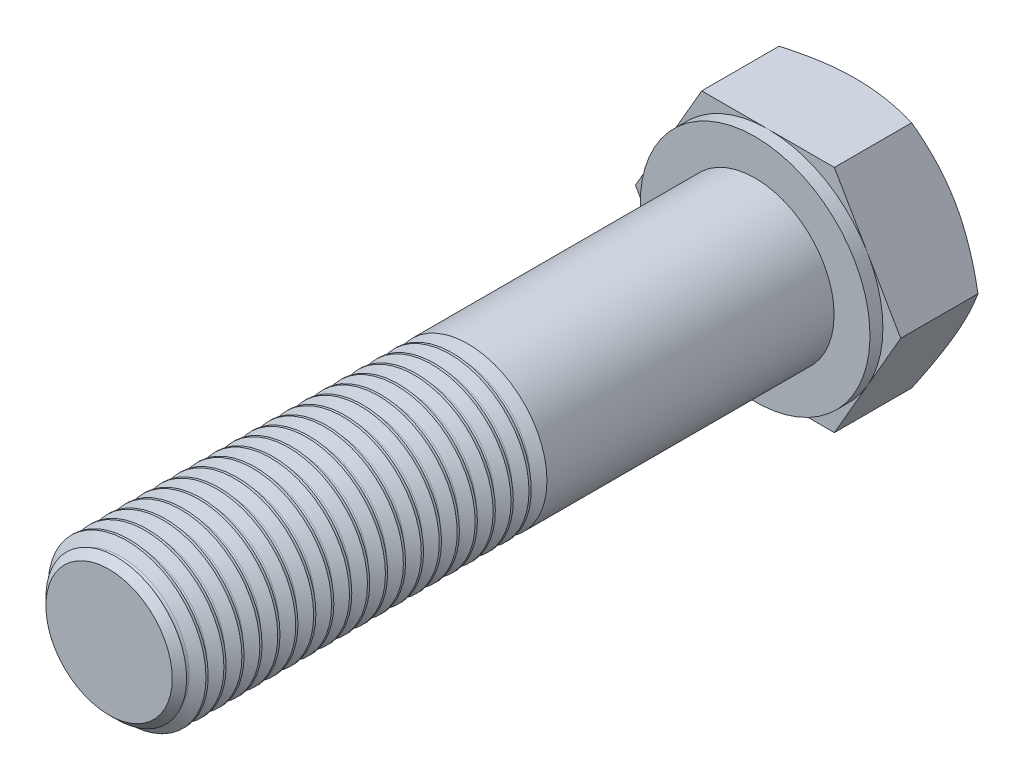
ISO-10303-21;
HEADER;
FILE_DESCRIPTION(('STEP AP214'),'2;1');
FILE_NAME('part.step','',(''),(''),'','','');
FILE_SCHEMA(('AUTOMOTIVE_DESIGN { 1 0 10303 214 1 1 1 1 }'));
ENDSEC;
DATA;
#1=APPLICATION_CONTEXT('core data for automotive mechanical design processes');
#2=APPLICATION_PROTOCOL_DEFINITION('international standard','automotive_design',2000,#1);
#3=PRODUCT_CONTEXT('',#1,'mechanical');
#4=PRODUCT('Part','Part','',(#3));
#5=PRODUCT_RELATED_PRODUCT_CATEGORY('part','',(#4));
#6=PRODUCT_DEFINITION_FORMATION('','',#4);
#7=PRODUCT_DEFINITION_CONTEXT('part definition',#1,'design');
#8=PRODUCT_DEFINITION('design','',#6,#7);
#9=PRODUCT_DEFINITION_SHAPE('','',#8);
#10=(LENGTH_UNIT() NAMED_UNIT(*) SI_UNIT(.MILLI.,.METRE.));
#11=(NAMED_UNIT(*) PLANE_ANGLE_UNIT() SI_UNIT($,.RADIAN.));
#12=(NAMED_UNIT(*) SI_UNIT($,.STERADIAN.) SOLID_ANGLE_UNIT());
#13=UNCERTAINTY_MEASURE_WITH_UNIT(LENGTH_MEASURE(1.E-05),#10,'distance_accuracy_value','');
#14=(GEOMETRIC_REPRESENTATION_CONTEXT(3) GLOBAL_UNCERTAINTY_ASSIGNED_CONTEXT((#13)) GLOBAL_UNIT_ASSIGNED_CONTEXT((#10,
#11,#12)) REPRESENTATION_CONTEXT('',''));
#15=CARTESIAN_POINT('',(0.,0.,0.));
#16=DIRECTION('',(0.,0.,1.));
#17=DIRECTION('',(1.,0.,0.));
#18=AXIS2_PLACEMENT_3D('',#15,#16,#17);
#19=CARTESIAN_POINT('',(0.,-16.,-1.8));
#20=DIRECTION('',(0.,0.,1.));
#21=DIRECTION('',(0.,-1.,0.));
#22=AXIS2_PLACEMENT_3D('',#19,#20,#21);
#23=PLANE('',#22);
#24=DIRECTION('',(-0.5,-0.866025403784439,0.));
#25=VECTOR('',#24,1.);
#26=CARTESIAN_POINT('',(-20.7846096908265,-4.,-1.79999999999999));
#27=LINE('',#26,#25);
#28=CARTESIAN_POINT('',(-13.856406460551,8.,-1.8));
#29=VERTEX_POINT('',#28);
#30=CARTESIAN_POINT('',(-18.475208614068,0.,-1.79999999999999));
#31=VERTEX_POINT('',#30);
#32=EDGE_CURVE('E557',#29,#31,#27,.T.);
#33=ORIENTED_EDGE('',*,*,#32,.T.);
#34=DIRECTION('',(0.5,-0.866025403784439,0.));
#35=VECTOR('',#34,1.);
#36=CARTESIAN_POINT('',(-6.92820323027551,-20.,-1.8));
#37=LINE('',#36,#35);
#38=CARTESIAN_POINT('',(-13.856406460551,-8.,-1.8));
#39=VERTEX_POINT('',#38);
#40=EDGE_CURVE('E598',#31,#39,#37,.T.);
#41=ORIENTED_EDGE('',*,*,#40,.T.);
#42=CARTESIAN_POINT('',(0.,0.,-1.79999999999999));
#43=DIRECTION('',(0.,0.,-1.));
#44=DIRECTION('',(0.,1.,0.));
#45=AXIS2_PLACEMENT_3D('',#42,#43,#44);
#46=CIRCLE('',#45,16.);
#47=EDGE_CURVE('E593',#39,#29,#46,.T.);
#48=ORIENTED_EDGE('',*,*,#47,.T.);
#49=EDGE_LOOP('',(#33,#41,#48));
#50=FACE_BOUND('',#49,.T.);
#51=ADVANCED_FACE('F34',(#50),#23,.T.);
#52=CARTESIAN_POINT('',(0.,-16.,-1.8));
#53=VERTEX_POINT('',#52);
#54=EDGE_CURVE('E518',#53,#39,#46,.T.);
#55=ORIENTED_EDGE('',*,*,#54,.T.);
#56=CARTESIAN_POINT('',(-9.23760430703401,-16.,-1.8));
#57=VERTEX_POINT('',#56);
#58=EDGE_CURVE('E547',#39,#57,#37,.T.);
#59=ORIENTED_EDGE('',*,*,#58,.T.);
#60=DIRECTION('',(1.,0.,0.));
#61=VECTOR('',#60,1.);
#62=CARTESIAN_POINT('',(0.,-16.,-1.8));
#63=LINE('',#62,#61);
#64=EDGE_CURVE('E205',#57,#53,#63,.T.);
#65=ORIENTED_EDGE('',*,*,#64,.T.);
#66=EDGE_LOOP('',(#55,#59,#65));
#67=FACE_BOUND('',#66,.T.);
#68=ADVANCED_FACE('F577',(#67),#23,.T.);
#69=CARTESIAN_POINT('',(13.856406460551,-8.,-1.8));
#70=VERTEX_POINT('',#69);
#71=EDGE_CURVE('E204',#70,#53,#46,.T.);
#72=ORIENTED_EDGE('',*,*,#71,.T.);
#73=CARTESIAN_POINT('',(9.23760430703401,-16.,-1.8));
#74=VERTEX_POINT('',#73);
#75=EDGE_CURVE('E192',#53,#74,#63,.T.);
#76=ORIENTED_EDGE('',*,*,#75,.T.);
#77=DIRECTION('',(0.5,0.866025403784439,0.));
#78=VECTOR('',#77,1.);
#79=CARTESIAN_POINT('',(6.92820323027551,-20.,-1.8));
#80=LINE('',#79,#78);
#81=EDGE_CURVE('E202',#74,#70,#80,.T.);
#82=ORIENTED_EDGE('',*,*,#81,.T.);
#83=EDGE_LOOP('',(#72,#76,#82));
#84=FACE_BOUND('',#83,.T.);
#85=ADVANCED_FACE('F201',(#84),#23,.T.);
#86=DIRECTION('',(-1.,0.,0.));
#87=VECTOR('',#86,1.);
#88=CARTESIAN_POINT('',(0.,16.,-1.79999999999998));
#89=LINE('',#88,#87);
#90=CARTESIAN_POINT('',(0.,16.,-1.8));
#91=VERTEX_POINT('',#90);
#92=CARTESIAN_POINT('',(-9.23760430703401,16.,-1.79999999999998));
#93=VERTEX_POINT('',#92);
#94=EDGE_CURVE('E146',#91,#93,#89,.T.);
#95=ORIENTED_EDGE('',*,*,#94,.T.);
#96=EDGE_CURVE('E560',#93,#29,#27,.T.);
#97=ORIENTED_EDGE('',*,*,#96,.T.);
#98=EDGE_CURVE('E230',#29,#91,#46,.T.);
#99=ORIENTED_EDGE('',*,*,#98,.T.);
#100=EDGE_LOOP('',(#95,#97,#99));
#101=FACE_BOUND('',#100,.T.);
#102=ADVANCED_FACE('F589',(#101),#23,.T.);
#103=CARTESIAN_POINT('',(13.856406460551,8.,-1.8));
#104=VERTEX_POINT('',#103);
#105=EDGE_CURVE('E235',#104,#70,#46,.T.);
#106=ORIENTED_EDGE('',*,*,#105,.T.);
#107=CARTESIAN_POINT('',(18.475208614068,0.,-1.79999999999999));
#108=VERTEX_POINT('',#107);
#109=EDGE_CURVE('E221',#70,#108,#80,.T.);
#110=ORIENTED_EDGE('',*,*,#109,.T.);
#111=DIRECTION('',(-0.5,0.866025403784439,0.));
#112=VECTOR('',#111,1.);
#113=CARTESIAN_POINT('',(20.7846096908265,-3.99999999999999,-1.79999999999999));
#114=LINE('',#113,#112);
#115=EDGE_CURVE('E144',#108,#104,#114,.T.);
#116=ORIENTED_EDGE('',*,*,#115,.T.);
#117=EDGE_LOOP('',(#106,#110,#116));
#118=FACE_BOUND('',#117,.T.);
#119=ADVANCED_FACE('F520',(#118),#23,.T.);
#120=CARTESIAN_POINT('',(9.23760430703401,16.,-1.79999999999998));
#121=VERTEX_POINT('',#120);
#122=EDGE_CURVE('E129',#104,#121,#114,.T.);
#123=ORIENTED_EDGE('',*,*,#122,.T.);
#124=EDGE_CURVE('E136',#121,#91,#89,.T.);
#125=ORIENTED_EDGE('',*,*,#124,.T.);
#126=EDGE_CURVE('E231',#91,#104,#46,.T.);
#127=ORIENTED_EDGE('',*,*,#126,.T.);
#128=EDGE_LOOP('',(#123,#125,#127));
#129=FACE_BOUND('',#128,.T.);
#130=ADVANCED_FACE('F504',(#129),#23,.T.);
#131=CARTESIAN_POINT('',(0.,0.,0.));
#132=DIRECTION('',(0.,0.,-1.));
#133=DIRECTION('',(0.,1.,0.));
#134=AXIS2_PLACEMENT_3D('',#131,#132,#133);
#135=PLANE('',#134);
#136=CARTESIAN_POINT('',(0.,0.,0.));
#137=DIRECTION('',(0.,0.,-1.));
#138=DIRECTION('',(0.,1.,0.));
#139=AXIS2_PLACEMENT_3D('',#136,#137,#138);
#140=CIRCLE('',#139,11.);
#141=CARTESIAN_POINT('',(0.,11.,0.));
#142=VERTEX_POINT('',#141);
#143=EDGE_CURVE('E234',#142,#142,#140,.T.);
#144=ORIENTED_EDGE('',*,*,#143,.T.);
#145=EDGE_LOOP('',(#144));
#146=FACE_BOUND('',#145,.T.);
#147=CARTESIAN_POINT('',(0.,0.,0.));
#148=DIRECTION('',(0.,0.,-1.));
#149=DIRECTION('',(0.,1.,0.));
#150=AXIS2_PLACEMENT_3D('',#147,#148,#149);
#151=CIRCLE('',#150,16.);
#152=CARTESIAN_POINT('',(0.,16.,0.));
#153=VERTEX_POINT('',#152);
#154=EDGE_CURVE('E225',#153,#153,#151,.T.);
#155=ORIENTED_EDGE('',*,*,#154,.F.);
#156=EDGE_LOOP('',(#155));
#157=FACE_BOUND('',#156,.T.);
#158=ADVANCED_FACE('F501',(#146,#157),#135,.F.);
#159=CARTESIAN_POINT('',(0.,0.,90.));
#160=DIRECTION('',(0.,0.,1.));
#161=DIRECTION('',(1.,0.,0.));
#162=AXIS2_PLACEMENT_3D('',#159,#160,#161);
#163=CYLINDRICAL_SURFACE('',#162,11.);
#164=CARTESIAN_POINT('',(0.,0.,42.5));
#165=DIRECTION('',(0.,0.,1.));
#166=DIRECTION('',(1.,0.,0.));
#167=AXIS2_PLACEMENT_3D('',#164,#165,#166);
#168=CIRCLE('',#167,11.);
#169=CARTESIAN_POINT('',(11.,0.,42.5));
#170=VERTEX_POINT('',#169);
#171=EDGE_CURVE('E457',#170,#170,#168,.T.);
#172=ORIENTED_EDGE('',*,*,#171,.F.);
#173=EDGE_LOOP('',(#172));
#174=FACE_BOUND('',#173,.T.);
#175=CARTESIAN_POINT('',(0.,0.,42.1875));
#176=DIRECTION('',(0.,0.,1.));
#177=DIRECTION('',(1.,0.,0.));
#178=AXIS2_PLACEMENT_3D('',#175,#176,#177);
#179=CIRCLE('',#178,11.);
#180=CARTESIAN_POINT('',(11.,0.,42.1875));
#181=VERTEX_POINT('',#180);
#182=EDGE_CURVE('E43',#181,#181,#179,.T.);
#183=ORIENTED_EDGE('',*,*,#182,.T.);
#184=EDGE_LOOP('',(#183));
#185=FACE_BOUND('',#184,.T.);
#186=ADVANCED_FACE('F475',(#174,#185),#163,.T.);
#187=CARTESIAN_POINT('',(0.,0.,41.328125));
#188=DIRECTION('',(0.,0.,1.));
#189=DIRECTION('',(1.,0.,0.));
#190=AXIS2_PLACEMENT_3D('',#187,#188,#189);
#191=CONICAL_SURFACE('',#190,9.5115188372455,1.0471975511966);
#192=ORIENTED_EDGE('',*,*,#182,.F.);
#193=EDGE_LOOP('',(#192));
#194=FACE_BOUND('',#193,.T.);
#195=CARTESIAN_POINT('',(0.,0.,41.328125));
#196=DIRECTION('',(0.,0.,1.));
#197=DIRECTION('',(1.,0.,0.));
#198=AXIS2_PLACEMENT_3D('',#195,#196,#197);
#199=CIRCLE('',#198,9.5115188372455);
#200=CARTESIAN_POINT('',(9.5115188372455,0.,41.328125));
#201=VERTEX_POINT('',#200);
#202=EDGE_CURVE('E463',#201,#201,#199,.T.);
#203=ORIENTED_EDGE('',*,*,#202,.T.);
#204=EDGE_LOOP('',(#203));
#205=FACE_BOUND('',#204,.T.);
#206=ADVANCED_FACE('F477',(#194,#205),#191,.T.);
#207=CARTESIAN_POINT('',(0.,0.,40.));
#208=DIRECTION('',(0.,0.,-1.));
#209=DIRECTION('',(-1.,0.,0.));
#210=AXIS2_PLACEMENT_3D('',#207,#208,#209);
#211=CONICAL_SURFACE('',#210,11.,1.0471975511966);
#212=CARTESIAN_POINT('',(0.,0.,40.859375));
#213=DIRECTION('',(0.,0.,1.));
#214=DIRECTION('',(1.,0.,0.));
#215=AXIS2_PLACEMENT_3D('',#212,#213,#214);
#216=CIRCLE('',#215,9.5115188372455);
#217=CARTESIAN_POINT('',(9.5115188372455,0.,40.859375));
#218=VERTEX_POINT('',#217);
#219=EDGE_CURVE('E466',#218,#218,#216,.T.);
#220=ORIENTED_EDGE('',*,*,#219,.F.);
#221=EDGE_LOOP('',(#220));
#222=FACE_BOUND('',#221,.T.);
#223=CARTESIAN_POINT('',(0.,0.,40.));
#224=DIRECTION('',(0.,0.,1.));
#225=DIRECTION('',(1.,0.,0.));
#226=AXIS2_PLACEMENT_3D('',#223,#224,#225);
#227=CIRCLE('',#226,11.);
#228=CARTESIAN_POINT('',(11.,0.,40.));
#229=VERTEX_POINT('',#228);
#230=EDGE_CURVE('E469',#229,#229,#227,.T.);
#231=ORIENTED_EDGE('',*,*,#230,.T.);
#232=EDGE_LOOP('',(#231));
#233=FACE_BOUND('',#232,.T.);
#234=ADVANCED_FACE('F480',(#222,#233),#211,.T.);
#235=CARTESIAN_POINT('',(0.,0.,41.09375));
#236=DIRECTION('',(0.,0.,1.));
#237=DIRECTION('',(1.,0.,0.));
#238=AXIS2_PLACEMENT_3D('',#235,#236,#237);
#239=TOROIDAL_SURFACE('',#238,9.64683530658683,0.270632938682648);
#240=ORIENTED_EDGE('',*,*,#202,.F.);
#241=EDGE_LOOP('',(#240));
#242=FACE_BOUND('',#241,.T.);
#243=ORIENTED_EDGE('',*,*,#219,.T.);
#244=EDGE_LOOP('',(#243));
#245=FACE_BOUND('',#244,.T.);
#246=ADVANCED_FACE('F484',(#242,#245),#239,.F.);
#247=ORIENTED_EDGE('',*,*,#230,.F.);
#248=EDGE_LOOP('',(#247));
#249=FACE_BOUND('',#248,.T.);
#250=ORIENTED_EDGE('',*,*,#143,.F.);
#251=EDGE_LOOP('',(#250));
#252=FACE_BOUND('',#251,.T.);
#253=ADVANCED_FACE('F36',(#249,#252),#163,.T.);
#254=CARTESIAN_POINT('',(0.,0.,43.828125));
#255=DIRECTION('',(0.,0.,1.));
#256=DIRECTION('',(1.,0.,0.));
#257=AXIS2_PLACEMENT_3D('',#254,#255,#256);
#258=CONICAL_SURFACE('',#257,9.5115188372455,1.0471975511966);
#259=CARTESIAN_POINT('',(0.,0.,44.6875));
#260=DIRECTION('',(0.,0.,1.));
#261=DIRECTION('',(1.,0.,0.));
#262=AXIS2_PLACEMENT_3D('',#259,#260,#261);
#263=CIRCLE('',#262,11.);
#264=CARTESIAN_POINT('',(11.,0.,44.6875));
#265=VERTEX_POINT('',#264);
#266=EDGE_CURVE('E460',#265,#265,#263,.T.);
#267=ORIENTED_EDGE('',*,*,#266,.F.);
#268=EDGE_LOOP('',(#267));
#269=FACE_BOUND('',#268,.T.);
#270=CARTESIAN_POINT('',(0.,0.,43.828125));
#271=DIRECTION('',(0.,0.,1.));
#272=DIRECTION('',(1.,0.,0.));
#273=AXIS2_PLACEMENT_3D('',#270,#271,#272);
#274=CIRCLE('',#273,9.5115188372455);
#275=CARTESIAN_POINT('',(9.5115188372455,0.,43.828125));
#276=VERTEX_POINT('',#275);
#277=EDGE_CURVE('E451',#276,#276,#274,.T.);
#278=ORIENTED_EDGE('',*,*,#277,.T.);
#279=EDGE_LOOP('',(#278));
#280=FACE_BOUND('',#279,.T.);
#281=ADVANCED_FACE('F497',(#269,#280),#258,.T.);
#282=CARTESIAN_POINT('',(0.,0.,42.5));
#283=DIRECTION('',(0.,0.,-1.));
#284=DIRECTION('',(-1.,0.,0.));
#285=AXIS2_PLACEMENT_3D('',#282,#283,#284);
#286=CONICAL_SURFACE('',#285,11.,1.0471975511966);
#287=CARTESIAN_POINT('',(0.,0.,43.359375));
#288=DIRECTION('',(0.,0.,1.));
#289=DIRECTION('',(1.,0.,0.));
#290=AXIS2_PLACEMENT_3D('',#287,#288,#289);
#291=CIRCLE('',#290,9.5115188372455);
#292=CARTESIAN_POINT('',(9.5115188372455,0.,43.359375));
#293=VERTEX_POINT('',#292);
#294=EDGE_CURVE('E454',#293,#293,#291,.T.);
#295=ORIENTED_EDGE('',*,*,#294,.F.);
#296=EDGE_LOOP('',(#295));
#297=FACE_BOUND('',#296,.T.);
#298=ORIENTED_EDGE('',*,*,#171,.T.);
#299=EDGE_LOOP('',(#298));
#300=FACE_BOUND('',#299,.T.);
#301=ADVANCED_FACE('F1453',(#297,#300),#286,.T.);
#302=CARTESIAN_POINT('',(0.,0.,43.59375));
#303=DIRECTION('',(0.,0.,1.));
#304=DIRECTION('',(1.,0.,0.));
#305=AXIS2_PLACEMENT_3D('',#302,#303,#304);
#306=TOROIDAL_SURFACE('',#305,9.64683530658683,0.270632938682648);
#307=ORIENTED_EDGE('',*,*,#277,.F.);
#308=EDGE_LOOP('',(#307));
#309=FACE_BOUND('',#308,.T.);
#310=ORIENTED_EDGE('',*,*,#294,.T.);
#311=EDGE_LOOP('',(#310));
#312=FACE_BOUND('',#311,.T.);
#313=ADVANCED_FACE('F1444',(#309,#312),#306,.F.);
#314=CARTESIAN_POINT('',(0.,0.,45.));
#315=DIRECTION('',(0.,0.,1.));
#316=DIRECTION('',(1.,0.,0.));
#317=AXIS2_PLACEMENT_3D('',#314,#315,#316);
#318=CIRCLE('',#317,11.);
#319=CARTESIAN_POINT('',(11.,0.,45.));
#320=VERTEX_POINT('',#319);
#321=EDGE_CURVE('E445',#320,#320,#318,.T.);
#322=ORIENTED_EDGE('',*,*,#321,.F.);
#323=EDGE_LOOP('',(#322));
#324=FACE_BOUND('',#323,.T.);
#325=ORIENTED_EDGE('',*,*,#266,.T.);
#326=EDGE_LOOP('',(#325));
#327=FACE_BOUND('',#326,.T.);
#328=ADVANCED_FACE('F1407',(#324,#327),#163,.T.);
#329=CARTESIAN_POINT('',(0.,0.,46.328125));
#330=DIRECTION('',(0.,0.,1.));
#331=DIRECTION('',(1.,0.,0.));
#332=AXIS2_PLACEMENT_3D('',#329,#330,#331);
#333=CONICAL_SURFACE('',#332,9.5115188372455,1.0471975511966);
#334=CARTESIAN_POINT('',(0.,0.,47.1875));
#335=DIRECTION('',(0.,0.,1.));
#336=DIRECTION('',(1.,0.,0.));
#337=AXIS2_PLACEMENT_3D('',#334,#335,#336);
#338=CIRCLE('',#337,11.);
#339=CARTESIAN_POINT('',(11.,0.,47.1875));
#340=VERTEX_POINT('',#339);
#341=EDGE_CURVE('E448',#340,#340,#338,.T.);
#342=ORIENTED_EDGE('',*,*,#341,.F.);
#343=EDGE_LOOP('',(#342));
#344=FACE_BOUND('',#343,.T.);
#345=CARTESIAN_POINT('',(0.,0.,46.328125));
#346=DIRECTION('',(0.,0.,1.));
#347=DIRECTION('',(1.,0.,0.));
#348=AXIS2_PLACEMENT_3D('',#345,#346,#347);
#349=CIRCLE('',#348,9.5115188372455);
#350=CARTESIAN_POINT('',(9.5115188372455,0.,46.328125));
#351=VERTEX_POINT('',#350);
#352=EDGE_CURVE('E439',#351,#351,#349,.T.);
#353=ORIENTED_EDGE('',*,*,#352,.T.);
#354=EDGE_LOOP('',(#353));
#355=FACE_BOUND('',#354,.T.);
#356=ADVANCED_FACE('F1425',(#344,#355),#333,.T.);
#357=CARTESIAN_POINT('',(0.,0.,45.));
#358=DIRECTION('',(0.,0.,-1.));
#359=DIRECTION('',(-1.,0.,0.));
#360=AXIS2_PLACEMENT_3D('',#357,#358,#359);
#361=CONICAL_SURFACE('',#360,11.,1.0471975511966);
#362=CARTESIAN_POINT('',(0.,0.,45.859375));
#363=DIRECTION('',(0.,0.,1.));
#364=DIRECTION('',(1.,0.,0.));
#365=AXIS2_PLACEMENT_3D('',#362,#363,#364);
#366=CIRCLE('',#365,9.5115188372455);
#367=CARTESIAN_POINT('',(9.5115188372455,0.,45.859375));
#368=VERTEX_POINT('',#367);
#369=EDGE_CURVE('E442',#368,#368,#366,.T.);
#370=ORIENTED_EDGE('',*,*,#369,.F.);
#371=EDGE_LOOP('',(#370));
#372=FACE_BOUND('',#371,.T.);
#373=ORIENTED_EDGE('',*,*,#321,.T.);
#374=EDGE_LOOP('',(#373));
#375=FACE_BOUND('',#374,.T.);
#376=ADVANCED_FACE('F1415',(#372,#375),#361,.T.);
#377=CARTESIAN_POINT('',(0.,0.,46.09375));
#378=DIRECTION('',(0.,0.,1.));
#379=DIRECTION('',(1.,0.,0.));
#380=AXIS2_PLACEMENT_3D('',#377,#378,#379);
#381=TOROIDAL_SURFACE('',#380,9.64683530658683,0.270632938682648);
#382=ORIENTED_EDGE('',*,*,#352,.F.);
#383=EDGE_LOOP('',(#382));
#384=FACE_BOUND('',#383,.T.);
#385=ORIENTED_EDGE('',*,*,#369,.T.);
#386=EDGE_LOOP('',(#385));
#387=FACE_BOUND('',#386,.T.);
#388=ADVANCED_FACE('F1405',(#384,#387),#381,.F.);
#389=CARTESIAN_POINT('',(0.,0.,47.5));
#390=DIRECTION('',(0.,0.,1.));
#391=DIRECTION('',(1.,0.,0.));
#392=AXIS2_PLACEMENT_3D('',#389,#390,#391);
#393=CIRCLE('',#392,11.);
#394=CARTESIAN_POINT('',(11.,0.,47.5));
#395=VERTEX_POINT('',#394);
#396=EDGE_CURVE('E433',#395,#395,#393,.T.);
#397=ORIENTED_EDGE('',*,*,#396,.F.);
#398=EDGE_LOOP('',(#397));
#399=FACE_BOUND('',#398,.T.);
#400=ORIENTED_EDGE('',*,*,#341,.T.);
#401=EDGE_LOOP('',(#400));
#402=FACE_BOUND('',#401,.T.);
#403=ADVANCED_FACE('F1368',(#399,#402),#163,.T.);
#404=CARTESIAN_POINT('',(0.,0.,48.828125));
#405=DIRECTION('',(0.,0.,1.));
#406=DIRECTION('',(1.,0.,0.));
#407=AXIS2_PLACEMENT_3D('',#404,#405,#406);
#408=CONICAL_SURFACE('',#407,9.5115188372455,1.0471975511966);
#409=CARTESIAN_POINT('',(0.,0.,49.6875));
#410=DIRECTION('',(0.,0.,1.));
#411=DIRECTION('',(1.,0.,0.));
#412=AXIS2_PLACEMENT_3D('',#409,#410,#411);
#413=CIRCLE('',#412,11.);
#414=CARTESIAN_POINT('',(11.,0.,49.6875));
#415=VERTEX_POINT('',#414);
#416=EDGE_CURVE('E436',#415,#415,#413,.T.);
#417=ORIENTED_EDGE('',*,*,#416,.F.);
#418=EDGE_LOOP('',(#417));
#419=FACE_BOUND('',#418,.T.);
#420=CARTESIAN_POINT('',(0.,0.,48.828125));
#421=DIRECTION('',(0.,0.,1.));
#422=DIRECTION('',(1.,0.,0.));
#423=AXIS2_PLACEMENT_3D('',#420,#421,#422);
#424=CIRCLE('',#423,9.5115188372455);
#425=CARTESIAN_POINT('',(9.5115188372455,0.,48.828125));
#426=VERTEX_POINT('',#425);
#427=EDGE_CURVE('E427',#426,#426,#424,.T.);
#428=ORIENTED_EDGE('',*,*,#427,.T.);
#429=EDGE_LOOP('',(#428));
#430=FACE_BOUND('',#429,.T.);
#431=ADVANCED_FACE('F1386',(#419,#430),#408,.T.);
#432=CARTESIAN_POINT('',(0.,0.,47.5));
#433=DIRECTION('',(0.,0.,-1.));
#434=DIRECTION('',(-1.,0.,0.));
#435=AXIS2_PLACEMENT_3D('',#432,#433,#434);
#436=CONICAL_SURFACE('',#435,11.,1.0471975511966);
#437=CARTESIAN_POINT('',(0.,0.,48.359375));
#438=DIRECTION('',(0.,0.,1.));
#439=DIRECTION('',(1.,0.,0.));
#440=AXIS2_PLACEMENT_3D('',#437,#438,#439);
#441=CIRCLE('',#440,9.5115188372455);
#442=CARTESIAN_POINT('',(9.5115188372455,0.,48.359375));
#443=VERTEX_POINT('',#442);
#444=EDGE_CURVE('E430',#443,#443,#441,.T.);
#445=ORIENTED_EDGE('',*,*,#444,.F.);
#446=EDGE_LOOP('',(#445));
#447=FACE_BOUND('',#446,.T.);
#448=ORIENTED_EDGE('',*,*,#396,.T.);
#449=EDGE_LOOP('',(#448));
#450=FACE_BOUND('',#449,.T.);
#451=ADVANCED_FACE('F1376',(#447,#450),#436,.T.);
#452=CARTESIAN_POINT('',(0.,0.,48.59375));
#453=DIRECTION('',(0.,0.,1.));
#454=DIRECTION('',(1.,0.,0.));
#455=AXIS2_PLACEMENT_3D('',#452,#453,#454);
#456=TOROIDAL_SURFACE('',#455,9.64683530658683,0.270632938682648);
#457=ORIENTED_EDGE('',*,*,#427,.F.);
#458=EDGE_LOOP('',(#457));
#459=FACE_BOUND('',#458,.T.);
#460=ORIENTED_EDGE('',*,*,#444,.T.);
#461=EDGE_LOOP('',(#460));
#462=FACE_BOUND('',#461,.T.);
#463=ADVANCED_FACE('F1366',(#459,#462),#456,.F.);
#464=CARTESIAN_POINT('',(0.,0.,50.));
#465=DIRECTION('',(0.,0.,1.));
#466=DIRECTION('',(1.,0.,0.));
#467=AXIS2_PLACEMENT_3D('',#464,#465,#466);
#468=CIRCLE('',#467,11.);
#469=CARTESIAN_POINT('',(11.,0.,50.));
#470=VERTEX_POINT('',#469);
#471=EDGE_CURVE('E421',#470,#470,#468,.T.);
#472=ORIENTED_EDGE('',*,*,#471,.F.);
#473=EDGE_LOOP('',(#472));
#474=FACE_BOUND('',#473,.T.);
#475=ORIENTED_EDGE('',*,*,#416,.T.);
#476=EDGE_LOOP('',(#475));
#477=FACE_BOUND('',#476,.T.);
#478=ADVANCED_FACE('F1329',(#474,#477),#163,.T.);
#479=CARTESIAN_POINT('',(0.,0.,51.328125));
#480=DIRECTION('',(0.,0.,1.));
#481=DIRECTION('',(1.,0.,0.));
#482=AXIS2_PLACEMENT_3D('',#479,#480,#481);
#483=CONICAL_SURFACE('',#482,9.5115188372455,1.0471975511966);
#484=CARTESIAN_POINT('',(0.,0.,52.1875));
#485=DIRECTION('',(0.,0.,1.));
#486=DIRECTION('',(1.,0.,0.));
#487=AXIS2_PLACEMENT_3D('',#484,#485,#486);
#488=CIRCLE('',#487,11.);
#489=CARTESIAN_POINT('',(11.,0.,52.1875));
#490=VERTEX_POINT('',#489);
#491=EDGE_CURVE('E424',#490,#490,#488,.T.);
#492=ORIENTED_EDGE('',*,*,#491,.F.);
#493=EDGE_LOOP('',(#492));
#494=FACE_BOUND('',#493,.T.);
#495=CARTESIAN_POINT('',(0.,0.,51.328125));
#496=DIRECTION('',(0.,0.,1.));
#497=DIRECTION('',(1.,0.,0.));
#498=AXIS2_PLACEMENT_3D('',#495,#496,#497);
#499=CIRCLE('',#498,9.5115188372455);
#500=CARTESIAN_POINT('',(9.5115188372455,0.,51.328125));
#501=VERTEX_POINT('',#500);
#502=EDGE_CURVE('E415',#501,#501,#499,.T.);
#503=ORIENTED_EDGE('',*,*,#502,.T.);
#504=EDGE_LOOP('',(#503));
#505=FACE_BOUND('',#504,.T.);
#506=ADVANCED_FACE('F1347',(#494,#505),#483,.T.);
#507=CARTESIAN_POINT('',(0.,0.,50.));
#508=DIRECTION('',(0.,0.,-1.));
#509=DIRECTION('',(-1.,0.,0.));
#510=AXIS2_PLACEMENT_3D('',#507,#508,#509);
#511=CONICAL_SURFACE('',#510,11.,1.0471975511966);
#512=CARTESIAN_POINT('',(0.,0.,50.859375));
#513=DIRECTION('',(0.,0.,1.));
#514=DIRECTION('',(1.,0.,0.));
#515=AXIS2_PLACEMENT_3D('',#512,#513,#514);
#516=CIRCLE('',#515,9.5115188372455);
#517=CARTESIAN_POINT('',(9.5115188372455,0.,50.859375));
#518=VERTEX_POINT('',#517);
#519=EDGE_CURVE('E418',#518,#518,#516,.T.);
#520=ORIENTED_EDGE('',*,*,#519,.F.);
#521=EDGE_LOOP('',(#520));
#522=FACE_BOUND('',#521,.T.);
#523=ORIENTED_EDGE('',*,*,#471,.T.);
#524=EDGE_LOOP('',(#523));
#525=FACE_BOUND('',#524,.T.);
#526=ADVANCED_FACE('F1337',(#522,#525),#511,.T.);
#527=CARTESIAN_POINT('',(0.,0.,51.09375));
#528=DIRECTION('',(0.,0.,1.));
#529=DIRECTION('',(1.,0.,0.));
#530=AXIS2_PLACEMENT_3D('',#527,#528,#529);
#531=TOROIDAL_SURFACE('',#530,9.64683530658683,0.270632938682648);
#532=ORIENTED_EDGE('',*,*,#502,.F.);
#533=EDGE_LOOP('',(#532));
#534=FACE_BOUND('',#533,.T.);
#535=ORIENTED_EDGE('',*,*,#519,.T.);
#536=EDGE_LOOP('',(#535));
#537=FACE_BOUND('',#536,.T.);
#538=ADVANCED_FACE('F1327',(#534,#537),#531,.F.);
#539=CARTESIAN_POINT('',(0.,0.,52.5));
#540=DIRECTION('',(0.,0.,1.));
#541=DIRECTION('',(1.,0.,0.));
#542=AXIS2_PLACEMENT_3D('',#539,#540,#541);
#543=CIRCLE('',#542,11.);
#544=CARTESIAN_POINT('',(11.,0.,52.5));
#545=VERTEX_POINT('',#544);
#546=EDGE_CURVE('E409',#545,#545,#543,.T.);
#547=ORIENTED_EDGE('',*,*,#546,.F.);
#548=EDGE_LOOP('',(#547));
#549=FACE_BOUND('',#548,.T.);
#550=ORIENTED_EDGE('',*,*,#491,.T.);
#551=EDGE_LOOP('',(#550));
#552=FACE_BOUND('',#551,.T.);
#553=ADVANCED_FACE('F1290',(#549,#552),#163,.T.);
#554=CARTESIAN_POINT('',(0.,0.,53.828125));
#555=DIRECTION('',(0.,0.,1.));
#556=DIRECTION('',(1.,0.,0.));
#557=AXIS2_PLACEMENT_3D('',#554,#555,#556);
#558=CONICAL_SURFACE('',#557,9.5115188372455,1.0471975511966);
#559=CARTESIAN_POINT('',(0.,0.,54.6875));
#560=DIRECTION('',(0.,0.,1.));
#561=DIRECTION('',(1.,0.,0.));
#562=AXIS2_PLACEMENT_3D('',#559,#560,#561);
#563=CIRCLE('',#562,11.);
#564=CARTESIAN_POINT('',(11.,0.,54.6875));
#565=VERTEX_POINT('',#564);
#566=EDGE_CURVE('E412',#565,#565,#563,.T.);
#567=ORIENTED_EDGE('',*,*,#566,.F.);
#568=EDGE_LOOP('',(#567));
#569=FACE_BOUND('',#568,.T.);
#570=CARTESIAN_POINT('',(0.,0.,53.828125));
#571=DIRECTION('',(0.,0.,1.));
#572=DIRECTION('',(1.,0.,0.));
#573=AXIS2_PLACEMENT_3D('',#570,#571,#572);
#574=CIRCLE('',#573,9.5115188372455);
#575=CARTESIAN_POINT('',(9.5115188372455,0.,53.828125));
#576=VERTEX_POINT('',#575);
#577=EDGE_CURVE('E403',#576,#576,#574,.T.);
#578=ORIENTED_EDGE('',*,*,#577,.T.);
#579=EDGE_LOOP('',(#578));
#580=FACE_BOUND('',#579,.T.);
#581=ADVANCED_FACE('F1308',(#569,#580),#558,.T.);
#582=CARTESIAN_POINT('',(0.,0.,52.5));
#583=DIRECTION('',(0.,0.,-1.));
#584=DIRECTION('',(-1.,0.,0.));
#585=AXIS2_PLACEMENT_3D('',#582,#583,#584);
#586=CONICAL_SURFACE('',#585,11.,1.0471975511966);
#587=CARTESIAN_POINT('',(0.,0.,53.359375));
#588=DIRECTION('',(0.,0.,1.));
#589=DIRECTION('',(1.,0.,0.));
#590=AXIS2_PLACEMENT_3D('',#587,#588,#589);
#591=CIRCLE('',#590,9.5115188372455);
#592=CARTESIAN_POINT('',(9.5115188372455,0.,53.359375));
#593=VERTEX_POINT('',#592);
#594=EDGE_CURVE('E406',#593,#593,#591,.T.);
#595=ORIENTED_EDGE('',*,*,#594,.F.);
#596=EDGE_LOOP('',(#595));
#597=FACE_BOUND('',#596,.T.);
#598=ORIENTED_EDGE('',*,*,#546,.T.);
#599=EDGE_LOOP('',(#598));
#600=FACE_BOUND('',#599,.T.);
#601=ADVANCED_FACE('F1298',(#597,#600),#586,.T.);
#602=CARTESIAN_POINT('',(0.,0.,53.59375));
#603=DIRECTION('',(0.,0.,1.));
#604=DIRECTION('',(1.,0.,0.));
#605=AXIS2_PLACEMENT_3D('',#602,#603,#604);
#606=TOROIDAL_SURFACE('',#605,9.64683530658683,0.270632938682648);
#607=ORIENTED_EDGE('',*,*,#577,.F.);
#608=EDGE_LOOP('',(#607));
#609=FACE_BOUND('',#608,.T.);
#610=ORIENTED_EDGE('',*,*,#594,.T.);
#611=EDGE_LOOP('',(#610));
#612=FACE_BOUND('',#611,.T.);
#613=ADVANCED_FACE('F1288',(#609,#612),#606,.F.);
#614=CARTESIAN_POINT('',(0.,0.,55.));
#615=DIRECTION('',(0.,0.,1.));
#616=DIRECTION('',(1.,0.,0.));
#617=AXIS2_PLACEMENT_3D('',#614,#615,#616);
#618=CIRCLE('',#617,11.);
#619=CARTESIAN_POINT('',(11.,0.,55.));
#620=VERTEX_POINT('',#619);
#621=EDGE_CURVE('E397',#620,#620,#618,.T.);
#622=ORIENTED_EDGE('',*,*,#621,.F.);
#623=EDGE_LOOP('',(#622));
#624=FACE_BOUND('',#623,.T.);
#625=ORIENTED_EDGE('',*,*,#566,.T.);
#626=EDGE_LOOP('',(#625));
#627=FACE_BOUND('',#626,.T.);
#628=ADVANCED_FACE('F1251',(#624,#627),#163,.T.);
#629=CARTESIAN_POINT('',(0.,0.,56.328125));
#630=DIRECTION('',(0.,0.,1.));
#631=DIRECTION('',(1.,0.,0.));
#632=AXIS2_PLACEMENT_3D('',#629,#630,#631);
#633=CONICAL_SURFACE('',#632,9.5115188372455,1.0471975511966);
#634=CARTESIAN_POINT('',(0.,0.,57.1875));
#635=DIRECTION('',(0.,0.,1.));
#636=DIRECTION('',(1.,0.,0.));
#637=AXIS2_PLACEMENT_3D('',#634,#635,#636);
#638=CIRCLE('',#637,11.);
#639=CARTESIAN_POINT('',(11.,0.,57.1875));
#640=VERTEX_POINT('',#639);
#641=EDGE_CURVE('E400',#640,#640,#638,.T.);
#642=ORIENTED_EDGE('',*,*,#641,.F.);
#643=EDGE_LOOP('',(#642));
#644=FACE_BOUND('',#643,.T.);
#645=CARTESIAN_POINT('',(0.,0.,56.328125));
#646=DIRECTION('',(0.,0.,1.));
#647=DIRECTION('',(1.,0.,0.));
#648=AXIS2_PLACEMENT_3D('',#645,#646,#647);
#649=CIRCLE('',#648,9.5115188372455);
#650=CARTESIAN_POINT('',(9.5115188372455,0.,56.328125));
#651=VERTEX_POINT('',#650);
#652=EDGE_CURVE('E391',#651,#651,#649,.T.);
#653=ORIENTED_EDGE('',*,*,#652,.T.);
#654=EDGE_LOOP('',(#653));
#655=FACE_BOUND('',#654,.T.);
#656=ADVANCED_FACE('F1269',(#644,#655),#633,.T.);
#657=CARTESIAN_POINT('',(0.,0.,55.));
#658=DIRECTION('',(0.,0.,-1.));
#659=DIRECTION('',(-1.,0.,0.));
#660=AXIS2_PLACEMENT_3D('',#657,#658,#659);
#661=CONICAL_SURFACE('',#660,11.,1.0471975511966);
#662=CARTESIAN_POINT('',(0.,0.,55.859375));
#663=DIRECTION('',(0.,0.,1.));
#664=DIRECTION('',(1.,0.,0.));
#665=AXIS2_PLACEMENT_3D('',#662,#663,#664);
#666=CIRCLE('',#665,9.5115188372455);
#667=CARTESIAN_POINT('',(9.5115188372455,0.,55.859375));
#668=VERTEX_POINT('',#667);
#669=EDGE_CURVE('E394',#668,#668,#666,.T.);
#670=ORIENTED_EDGE('',*,*,#669,.F.);
#671=EDGE_LOOP('',(#670));
#672=FACE_BOUND('',#671,.T.);
#673=ORIENTED_EDGE('',*,*,#621,.T.);
#674=EDGE_LOOP('',(#673));
#675=FACE_BOUND('',#674,.T.);
#676=ADVANCED_FACE('F1259',(#672,#675),#661,.T.);
#677=CARTESIAN_POINT('',(0.,0.,56.09375));
#678=DIRECTION('',(0.,0.,1.));
#679=DIRECTION('',(1.,0.,0.));
#680=AXIS2_PLACEMENT_3D('',#677,#678,#679);
#681=TOROIDAL_SURFACE('',#680,9.64683530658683,0.270632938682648);
#682=ORIENTED_EDGE('',*,*,#652,.F.);
#683=EDGE_LOOP('',(#682));
#684=FACE_BOUND('',#683,.T.);
#685=ORIENTED_EDGE('',*,*,#669,.T.);
#686=EDGE_LOOP('',(#685));
#687=FACE_BOUND('',#686,.T.);
#688=ADVANCED_FACE('F1249',(#684,#687),#681,.F.);
#689=CARTESIAN_POINT('',(0.,0.,57.5));
#690=DIRECTION('',(0.,0.,1.));
#691=DIRECTION('',(1.,0.,0.));
#692=AXIS2_PLACEMENT_3D('',#689,#690,#691);
#693=CIRCLE('',#692,11.);
#694=CARTESIAN_POINT('',(11.,0.,57.5));
#695=VERTEX_POINT('',#694);
#696=EDGE_CURVE('E385',#695,#695,#693,.T.);
#697=ORIENTED_EDGE('',*,*,#696,.F.);
#698=EDGE_LOOP('',(#697));
#699=FACE_BOUND('',#698,.T.);
#700=ORIENTED_EDGE('',*,*,#641,.T.);
#701=EDGE_LOOP('',(#700));
#702=FACE_BOUND('',#701,.T.);
#703=ADVANCED_FACE('F1212',(#699,#702),#163,.T.);
#704=CARTESIAN_POINT('',(0.,0.,58.828125));
#705=DIRECTION('',(0.,0.,1.));
#706=DIRECTION('',(1.,0.,0.));
#707=AXIS2_PLACEMENT_3D('',#704,#705,#706);
#708=CONICAL_SURFACE('',#707,9.5115188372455,1.0471975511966);
#709=CARTESIAN_POINT('',(0.,0.,59.6875));
#710=DIRECTION('',(0.,0.,1.));
#711=DIRECTION('',(1.,0.,0.));
#712=AXIS2_PLACEMENT_3D('',#709,#710,#711);
#713=CIRCLE('',#712,11.);
#714=CARTESIAN_POINT('',(11.,0.,59.6875));
#715=VERTEX_POINT('',#714);
#716=EDGE_CURVE('E388',#715,#715,#713,.T.);
#717=ORIENTED_EDGE('',*,*,#716,.F.);
#718=EDGE_LOOP('',(#717));
#719=FACE_BOUND('',#718,.T.);
#720=CARTESIAN_POINT('',(0.,0.,58.828125));
#721=DIRECTION('',(0.,0.,1.));
#722=DIRECTION('',(1.,0.,0.));
#723=AXIS2_PLACEMENT_3D('',#720,#721,#722);
#724=CIRCLE('',#723,9.5115188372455);
#725=CARTESIAN_POINT('',(9.5115188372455,0.,58.828125));
#726=VERTEX_POINT('',#725);
#727=EDGE_CURVE('E379',#726,#726,#724,.T.);
#728=ORIENTED_EDGE('',*,*,#727,.T.);
#729=EDGE_LOOP('',(#728));
#730=FACE_BOUND('',#729,.T.);
#731=ADVANCED_FACE('F1230',(#719,#730),#708,.T.);
#732=CARTESIAN_POINT('',(0.,0.,57.5));
#733=DIRECTION('',(0.,0.,-1.));
#734=DIRECTION('',(-1.,0.,0.));
#735=AXIS2_PLACEMENT_3D('',#732,#733,#734);
#736=CONICAL_SURFACE('',#735,11.,1.0471975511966);
#737=CARTESIAN_POINT('',(0.,0.,58.359375));
#738=DIRECTION('',(0.,0.,1.));
#739=DIRECTION('',(1.,0.,0.));
#740=AXIS2_PLACEMENT_3D('',#737,#738,#739);
#741=CIRCLE('',#740,9.5115188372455);
#742=CARTESIAN_POINT('',(9.5115188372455,0.,58.359375));
#743=VERTEX_POINT('',#742);
#744=EDGE_CURVE('E382',#743,#743,#741,.T.);
#745=ORIENTED_EDGE('',*,*,#744,.F.);
#746=EDGE_LOOP('',(#745));
#747=FACE_BOUND('',#746,.T.);
#748=ORIENTED_EDGE('',*,*,#696,.T.);
#749=EDGE_LOOP('',(#748));
#750=FACE_BOUND('',#749,.T.);
#751=ADVANCED_FACE('F1220',(#747,#750),#736,.T.);
#752=CARTESIAN_POINT('',(0.,0.,58.59375));
#753=DIRECTION('',(0.,0.,1.));
#754=DIRECTION('',(1.,0.,0.));
#755=AXIS2_PLACEMENT_3D('',#752,#753,#754);
#756=TOROIDAL_SURFACE('',#755,9.64683530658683,0.270632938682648);
#757=ORIENTED_EDGE('',*,*,#727,.F.);
#758=EDGE_LOOP('',(#757));
#759=FACE_BOUND('',#758,.T.);
#760=ORIENTED_EDGE('',*,*,#744,.T.);
#761=EDGE_LOOP('',(#760));
#762=FACE_BOUND('',#761,.T.);
#763=ADVANCED_FACE('F1210',(#759,#762),#756,.F.);
#764=CARTESIAN_POINT('',(0.,0.,60.));
#765=DIRECTION('',(0.,0.,1.));
#766=DIRECTION('',(1.,0.,0.));
#767=AXIS2_PLACEMENT_3D('',#764,#765,#766);
#768=CIRCLE('',#767,11.);
#769=CARTESIAN_POINT('',(11.,0.,60.));
#770=VERTEX_POINT('',#769);
#771=EDGE_CURVE('E373',#770,#770,#768,.T.);
#772=ORIENTED_EDGE('',*,*,#771,.F.);
#773=EDGE_LOOP('',(#772));
#774=FACE_BOUND('',#773,.T.);
#775=ORIENTED_EDGE('',*,*,#716,.T.);
#776=EDGE_LOOP('',(#775));
#777=FACE_BOUND('',#776,.T.);
#778=ADVANCED_FACE('F1173',(#774,#777),#163,.T.);
#779=CARTESIAN_POINT('',(0.,0.,61.328125));
#780=DIRECTION('',(0.,0.,1.));
#781=DIRECTION('',(1.,0.,0.));
#782=AXIS2_PLACEMENT_3D('',#779,#780,#781);
#783=CONICAL_SURFACE('',#782,9.5115188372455,1.0471975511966);
#784=CARTESIAN_POINT('',(0.,0.,62.1875));
#785=DIRECTION('',(0.,0.,1.));
#786=DIRECTION('',(1.,0.,0.));
#787=AXIS2_PLACEMENT_3D('',#784,#785,#786);
#788=CIRCLE('',#787,11.);
#789=CARTESIAN_POINT('',(11.,0.,62.1875));
#790=VERTEX_POINT('',#789);
#791=EDGE_CURVE('E376',#790,#790,#788,.T.);
#792=ORIENTED_EDGE('',*,*,#791,.F.);
#793=EDGE_LOOP('',(#792));
#794=FACE_BOUND('',#793,.T.);
#795=CARTESIAN_POINT('',(0.,0.,61.328125));
#796=DIRECTION('',(0.,0.,1.));
#797=DIRECTION('',(1.,0.,0.));
#798=AXIS2_PLACEMENT_3D('',#795,#796,#797);
#799=CIRCLE('',#798,9.5115188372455);
#800=CARTESIAN_POINT('',(9.5115188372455,0.,61.328125));
#801=VERTEX_POINT('',#800);
#802=EDGE_CURVE('E367',#801,#801,#799,.T.);
#803=ORIENTED_EDGE('',*,*,#802,.T.);
#804=EDGE_LOOP('',(#803));
#805=FACE_BOUND('',#804,.T.);
#806=ADVANCED_FACE('F1191',(#794,#805),#783,.T.);
#807=CARTESIAN_POINT('',(0.,0.,60.));
#808=DIRECTION('',(0.,0.,-1.));
#809=DIRECTION('',(-1.,0.,0.));
#810=AXIS2_PLACEMENT_3D('',#807,#808,#809);
#811=CONICAL_SURFACE('',#810,11.,1.0471975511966);
#812=CARTESIAN_POINT('',(0.,0.,60.859375));
#813=DIRECTION('',(0.,0.,1.));
#814=DIRECTION('',(1.,0.,0.));
#815=AXIS2_PLACEMENT_3D('',#812,#813,#814);
#816=CIRCLE('',#815,9.5115188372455);
#817=CARTESIAN_POINT('',(9.5115188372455,0.,60.859375));
#818=VERTEX_POINT('',#817);
#819=EDGE_CURVE('E370',#818,#818,#816,.T.);
#820=ORIENTED_EDGE('',*,*,#819,.F.);
#821=EDGE_LOOP('',(#820));
#822=FACE_BOUND('',#821,.T.);
#823=ORIENTED_EDGE('',*,*,#771,.T.);
#824=EDGE_LOOP('',(#823));
#825=FACE_BOUND('',#824,.T.);
#826=ADVANCED_FACE('F1181',(#822,#825),#811,.T.);
#827=CARTESIAN_POINT('',(0.,0.,61.09375));
#828=DIRECTION('',(0.,0.,1.));
#829=DIRECTION('',(1.,0.,0.));
#830=AXIS2_PLACEMENT_3D('',#827,#828,#829);
#831=TOROIDAL_SURFACE('',#830,9.64683530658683,0.270632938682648);
#832=ORIENTED_EDGE('',*,*,#802,.F.);
#833=EDGE_LOOP('',(#832));
#834=FACE_BOUND('',#833,.T.);
#835=ORIENTED_EDGE('',*,*,#819,.T.);
#836=EDGE_LOOP('',(#835));
#837=FACE_BOUND('',#836,.T.);
#838=ADVANCED_FACE('F1171',(#834,#837),#831,.F.);
#839=CARTESIAN_POINT('',(0.,0.,62.5));
#840=DIRECTION('',(0.,0.,1.));
#841=DIRECTION('',(1.,0.,0.));
#842=AXIS2_PLACEMENT_3D('',#839,#840,#841);
#843=CIRCLE('',#842,11.);
#844=CARTESIAN_POINT('',(11.,0.,62.5));
#845=VERTEX_POINT('',#844);
#846=EDGE_CURVE('E361',#845,#845,#843,.T.);
#847=ORIENTED_EDGE('',*,*,#846,.F.);
#848=EDGE_LOOP('',(#847));
#849=FACE_BOUND('',#848,.T.);
#850=ORIENTED_EDGE('',*,*,#791,.T.);
#851=EDGE_LOOP('',(#850));
#852=FACE_BOUND('',#851,.T.);
#853=ADVANCED_FACE('F1134',(#849,#852),#163,.T.);
#854=CARTESIAN_POINT('',(0.,0.,63.828125));
#855=DIRECTION('',(0.,0.,1.));
#856=DIRECTION('',(1.,0.,0.));
#857=AXIS2_PLACEMENT_3D('',#854,#855,#856);
#858=CONICAL_SURFACE('',#857,9.5115188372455,1.0471975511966);
#859=CARTESIAN_POINT('',(0.,0.,64.6875));
#860=DIRECTION('',(0.,0.,1.));
#861=DIRECTION('',(1.,0.,0.));
#862=AXIS2_PLACEMENT_3D('',#859,#860,#861);
#863=CIRCLE('',#862,11.);
#864=CARTESIAN_POINT('',(11.,0.,64.6875));
#865=VERTEX_POINT('',#864);
#866=EDGE_CURVE('E364',#865,#865,#863,.T.);
#867=ORIENTED_EDGE('',*,*,#866,.F.);
#868=EDGE_LOOP('',(#867));
#869=FACE_BOUND('',#868,.T.);
#870=CARTESIAN_POINT('',(0.,0.,63.828125));
#871=DIRECTION('',(0.,0.,1.));
#872=DIRECTION('',(1.,0.,0.));
#873=AXIS2_PLACEMENT_3D('',#870,#871,#872);
#874=CIRCLE('',#873,9.5115188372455);
#875=CARTESIAN_POINT('',(9.5115188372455,0.,63.828125));
#876=VERTEX_POINT('',#875);
#877=EDGE_CURVE('E355',#876,#876,#874,.T.);
#878=ORIENTED_EDGE('',*,*,#877,.T.);
#879=EDGE_LOOP('',(#878));
#880=FACE_BOUND('',#879,.T.);
#881=ADVANCED_FACE('F1152',(#869,#880),#858,.T.);
#882=CARTESIAN_POINT('',(0.,0.,62.5));
#883=DIRECTION('',(0.,0.,-1.));
#884=DIRECTION('',(-1.,0.,0.));
#885=AXIS2_PLACEMENT_3D('',#882,#883,#884);
#886=CONICAL_SURFACE('',#885,11.,1.0471975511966);
#887=CARTESIAN_POINT('',(0.,0.,63.359375));
#888=DIRECTION('',(0.,0.,1.));
#889=DIRECTION('',(1.,0.,0.));
#890=AXIS2_PLACEMENT_3D('',#887,#888,#889);
#891=CIRCLE('',#890,9.5115188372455);
#892=CARTESIAN_POINT('',(9.5115188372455,0.,63.359375));
#893=VERTEX_POINT('',#892);
#894=EDGE_CURVE('E358',#893,#893,#891,.T.);
#895=ORIENTED_EDGE('',*,*,#894,.F.);
#896=EDGE_LOOP('',(#895));
#897=FACE_BOUND('',#896,.T.);
#898=ORIENTED_EDGE('',*,*,#846,.T.);
#899=EDGE_LOOP('',(#898));
#900=FACE_BOUND('',#899,.T.);
#901=ADVANCED_FACE('F1142',(#897,#900),#886,.T.);
#902=CARTESIAN_POINT('',(0.,0.,63.59375));
#903=DIRECTION('',(0.,0.,1.));
#904=DIRECTION('',(1.,0.,0.));
#905=AXIS2_PLACEMENT_3D('',#902,#903,#904);
#906=TOROIDAL_SURFACE('',#905,9.64683530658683,0.270632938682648);
#907=ORIENTED_EDGE('',*,*,#877,.F.);
#908=EDGE_LOOP('',(#907));
#909=FACE_BOUND('',#908,.T.);
#910=ORIENTED_EDGE('',*,*,#894,.T.);
#911=EDGE_LOOP('',(#910));
#912=FACE_BOUND('',#911,.T.);
#913=ADVANCED_FACE('F1132',(#909,#912),#906,.F.);
#914=CARTESIAN_POINT('',(0.,0.,65.));
#915=DIRECTION('',(0.,0.,1.));
#916=DIRECTION('',(1.,0.,0.));
#917=AXIS2_PLACEMENT_3D('',#914,#915,#916);
#918=CIRCLE('',#917,11.);
#919=CARTESIAN_POINT('',(11.,0.,65.));
#920=VERTEX_POINT('',#919);
#921=EDGE_CURVE('E349',#920,#920,#918,.T.);
#922=ORIENTED_EDGE('',*,*,#921,.F.);
#923=EDGE_LOOP('',(#922));
#924=FACE_BOUND('',#923,.T.);
#925=ORIENTED_EDGE('',*,*,#866,.T.);
#926=EDGE_LOOP('',(#925));
#927=FACE_BOUND('',#926,.T.);
#928=ADVANCED_FACE('F1095',(#924,#927),#163,.T.);
#929=CARTESIAN_POINT('',(0.,0.,66.328125));
#930=DIRECTION('',(0.,0.,1.));
#931=DIRECTION('',(1.,0.,0.));
#932=AXIS2_PLACEMENT_3D('',#929,#930,#931);
#933=CONICAL_SURFACE('',#932,9.5115188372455,1.0471975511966);
#934=CARTESIAN_POINT('',(0.,0.,67.1875));
#935=DIRECTION('',(0.,0.,1.));
#936=DIRECTION('',(1.,0.,0.));
#937=AXIS2_PLACEMENT_3D('',#934,#935,#936);
#938=CIRCLE('',#937,11.);
#939=CARTESIAN_POINT('',(11.,0.,67.1875));
#940=VERTEX_POINT('',#939);
#941=EDGE_CURVE('E352',#940,#940,#938,.T.);
#942=ORIENTED_EDGE('',*,*,#941,.F.);
#943=EDGE_LOOP('',(#942));
#944=FACE_BOUND('',#943,.T.);
#945=CARTESIAN_POINT('',(0.,0.,66.328125));
#946=DIRECTION('',(0.,0.,1.));
#947=DIRECTION('',(1.,0.,0.));
#948=AXIS2_PLACEMENT_3D('',#945,#946,#947);
#949=CIRCLE('',#948,9.5115188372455);
#950=CARTESIAN_POINT('',(9.5115188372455,0.,66.328125));
#951=VERTEX_POINT('',#950);
#952=EDGE_CURVE('E343',#951,#951,#949,.T.);
#953=ORIENTED_EDGE('',*,*,#952,.T.);
#954=EDGE_LOOP('',(#953));
#955=FACE_BOUND('',#954,.T.);
#956=ADVANCED_FACE('F1113',(#944,#955),#933,.T.);
#957=CARTESIAN_POINT('',(0.,0.,65.));
#958=DIRECTION('',(0.,0.,-1.));
#959=DIRECTION('',(-1.,0.,0.));
#960=AXIS2_PLACEMENT_3D('',#957,#958,#959);
#961=CONICAL_SURFACE('',#960,11.,1.0471975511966);
#962=CARTESIAN_POINT('',(0.,0.,65.859375));
#963=DIRECTION('',(0.,0.,1.));
#964=DIRECTION('',(1.,0.,0.));
#965=AXIS2_PLACEMENT_3D('',#962,#963,#964);
#966=CIRCLE('',#965,9.5115188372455);
#967=CARTESIAN_POINT('',(9.5115188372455,0.,65.859375));
#968=VERTEX_POINT('',#967);
#969=EDGE_CURVE('E346',#968,#968,#966,.T.);
#970=ORIENTED_EDGE('',*,*,#969,.F.);
#971=EDGE_LOOP('',(#970));
#972=FACE_BOUND('',#971,.T.);
#973=ORIENTED_EDGE('',*,*,#921,.T.);
#974=EDGE_LOOP('',(#973));
#975=FACE_BOUND('',#974,.T.);
#976=ADVANCED_FACE('F1103',(#972,#975),#961,.T.);
#977=CARTESIAN_POINT('',(0.,0.,66.09375));
#978=DIRECTION('',(0.,0.,1.));
#979=DIRECTION('',(1.,0.,0.));
#980=AXIS2_PLACEMENT_3D('',#977,#978,#979);
#981=TOROIDAL_SURFACE('',#980,9.64683530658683,0.270632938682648);
#982=ORIENTED_EDGE('',*,*,#952,.F.);
#983=EDGE_LOOP('',(#982));
#984=FACE_BOUND('',#983,.T.);
#985=ORIENTED_EDGE('',*,*,#969,.T.);
#986=EDGE_LOOP('',(#985));
#987=FACE_BOUND('',#986,.T.);
#988=ADVANCED_FACE('F1093',(#984,#987),#981,.F.);
#989=CARTESIAN_POINT('',(0.,0.,67.5));
#990=DIRECTION('',(0.,0.,1.));
#991=DIRECTION('',(1.,0.,0.));
#992=AXIS2_PLACEMENT_3D('',#989,#990,#991);
#993=CIRCLE('',#992,11.);
#994=CARTESIAN_POINT('',(11.,0.,67.5));
#995=VERTEX_POINT('',#994);
#996=EDGE_CURVE('E337',#995,#995,#993,.T.);
#997=ORIENTED_EDGE('',*,*,#996,.F.);
#998=EDGE_LOOP('',(#997));
#999=FACE_BOUND('',#998,.T.);
#1000=ORIENTED_EDGE('',*,*,#941,.T.);
#1001=EDGE_LOOP('',(#1000));
#1002=FACE_BOUND('',#1001,.T.);
#1003=ADVANCED_FACE('F1056',(#999,#1002),#163,.T.);
#1004=CARTESIAN_POINT('',(0.,0.,68.828125));
#1005=DIRECTION('',(0.,0.,1.));
#1006=DIRECTION('',(1.,0.,0.));
#1007=AXIS2_PLACEMENT_3D('',#1004,#1005,#1006);
#1008=CONICAL_SURFACE('',#1007,9.5115188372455,1.0471975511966);
#1009=CARTESIAN_POINT('',(0.,0.,69.6875));
#1010=DIRECTION('',(0.,0.,1.));
#1011=DIRECTION('',(1.,0.,0.));
#1012=AXIS2_PLACEMENT_3D('',#1009,#1010,#1011);
#1013=CIRCLE('',#1012,11.);
#1014=CARTESIAN_POINT('',(11.,0.,69.6875));
#1015=VERTEX_POINT('',#1014);
#1016=EDGE_CURVE('E340',#1015,#1015,#1013,.T.);
#1017=ORIENTED_EDGE('',*,*,#1016,.F.);
#1018=EDGE_LOOP('',(#1017));
#1019=FACE_BOUND('',#1018,.T.);
#1020=CARTESIAN_POINT('',(0.,0.,68.828125));
#1021=DIRECTION('',(0.,0.,1.));
#1022=DIRECTION('',(1.,0.,0.));
#1023=AXIS2_PLACEMENT_3D('',#1020,#1021,#1022);
#1024=CIRCLE('',#1023,9.5115188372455);
#1025=CARTESIAN_POINT('',(9.5115188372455,0.,68.828125));
#1026=VERTEX_POINT('',#1025);
#1027=EDGE_CURVE('E331',#1026,#1026,#1024,.T.);
#1028=ORIENTED_EDGE('',*,*,#1027,.T.);
#1029=EDGE_LOOP('',(#1028));
#1030=FACE_BOUND('',#1029,.T.);
#1031=ADVANCED_FACE('F1074',(#1019,#1030),#1008,.T.);
#1032=CARTESIAN_POINT('',(0.,0.,67.5));
#1033=DIRECTION('',(0.,0.,-1.));
#1034=DIRECTION('',(-1.,0.,0.));
#1035=AXIS2_PLACEMENT_3D('',#1032,#1033,#1034);
#1036=CONICAL_SURFACE('',#1035,11.,1.0471975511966);
#1037=CARTESIAN_POINT('',(0.,0.,68.359375));
#1038=DIRECTION('',(0.,0.,1.));
#1039=DIRECTION('',(1.,0.,0.));
#1040=AXIS2_PLACEMENT_3D('',#1037,#1038,#1039);
#1041=CIRCLE('',#1040,9.5115188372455);
#1042=CARTESIAN_POINT('',(9.5115188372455,0.,68.359375));
#1043=VERTEX_POINT('',#1042);
#1044=EDGE_CURVE('E334',#1043,#1043,#1041,.T.);
#1045=ORIENTED_EDGE('',*,*,#1044,.F.);
#1046=EDGE_LOOP('',(#1045));
#1047=FACE_BOUND('',#1046,.T.);
#1048=ORIENTED_EDGE('',*,*,#996,.T.);
#1049=EDGE_LOOP('',(#1048));
#1050=FACE_BOUND('',#1049,.T.);
#1051=ADVANCED_FACE('F1064',(#1047,#1050),#1036,.T.);
#1052=CARTESIAN_POINT('',(0.,0.,68.59375));
#1053=DIRECTION('',(0.,0.,1.));
#1054=DIRECTION('',(1.,0.,0.));
#1055=AXIS2_PLACEMENT_3D('',#1052,#1053,#1054);
#1056=TOROIDAL_SURFACE('',#1055,9.64683530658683,0.270632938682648);
#1057=ORIENTED_EDGE('',*,*,#1027,.F.);
#1058=EDGE_LOOP('',(#1057));
#1059=FACE_BOUND('',#1058,.T.);
#1060=ORIENTED_EDGE('',*,*,#1044,.T.);
#1061=EDGE_LOOP('',(#1060));
#1062=FACE_BOUND('',#1061,.T.);
#1063=ADVANCED_FACE('F1054',(#1059,#1062),#1056,.F.);
#1064=CARTESIAN_POINT('',(0.,0.,70.));
#1065=DIRECTION('',(0.,0.,1.));
#1066=DIRECTION('',(1.,0.,0.));
#1067=AXIS2_PLACEMENT_3D('',#1064,#1065,#1066);
#1068=CIRCLE('',#1067,11.);
#1069=CARTESIAN_POINT('',(11.,0.,70.));
#1070=VERTEX_POINT('',#1069);
#1071=EDGE_CURVE('E325',#1070,#1070,#1068,.T.);
#1072=ORIENTED_EDGE('',*,*,#1071,.F.);
#1073=EDGE_LOOP('',(#1072));
#1074=FACE_BOUND('',#1073,.T.);
#1075=ORIENTED_EDGE('',*,*,#1016,.T.);
#1076=EDGE_LOOP('',(#1075));
#1077=FACE_BOUND('',#1076,.T.);
#1078=ADVANCED_FACE('F1017',(#1074,#1077),#163,.T.);
#1079=CARTESIAN_POINT('',(0.,0.,71.328125));
#1080=DIRECTION('',(0.,0.,1.));
#1081=DIRECTION('',(1.,0.,0.));
#1082=AXIS2_PLACEMENT_3D('',#1079,#1080,#1081);
#1083=CONICAL_SURFACE('',#1082,9.5115188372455,1.0471975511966);
#1084=CARTESIAN_POINT('',(0.,0.,72.1875));
#1085=DIRECTION('',(0.,0.,1.));
#1086=DIRECTION('',(1.,0.,0.));
#1087=AXIS2_PLACEMENT_3D('',#1084,#1085,#1086);
#1088=CIRCLE('',#1087,11.);
#1089=CARTESIAN_POINT('',(11.,0.,72.1875));
#1090=VERTEX_POINT('',#1089);
#1091=EDGE_CURVE('E328',#1090,#1090,#1088,.T.);
#1092=ORIENTED_EDGE('',*,*,#1091,.F.);
#1093=EDGE_LOOP('',(#1092));
#1094=FACE_BOUND('',#1093,.T.);
#1095=CARTESIAN_POINT('',(0.,0.,71.328125));
#1096=DIRECTION('',(0.,0.,1.));
#1097=DIRECTION('',(1.,0.,0.));
#1098=AXIS2_PLACEMENT_3D('',#1095,#1096,#1097);
#1099=CIRCLE('',#1098,9.5115188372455);
#1100=CARTESIAN_POINT('',(9.5115188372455,0.,71.328125));
#1101=VERTEX_POINT('',#1100);
#1102=EDGE_CURVE('E319',#1101,#1101,#1099,.T.);
#1103=ORIENTED_EDGE('',*,*,#1102,.T.);
#1104=EDGE_LOOP('',(#1103));
#1105=FACE_BOUND('',#1104,.T.);
#1106=ADVANCED_FACE('F1035',(#1094,#1105),#1083,.T.);
#1107=CARTESIAN_POINT('',(0.,0.,70.));
#1108=DIRECTION('',(0.,0.,-1.));
#1109=DIRECTION('',(-1.,0.,0.));
#1110=AXIS2_PLACEMENT_3D('',#1107,#1108,#1109);
#1111=CONICAL_SURFACE('',#1110,11.,1.0471975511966);
#1112=CARTESIAN_POINT('',(0.,0.,70.859375));
#1113=DIRECTION('',(0.,0.,1.));
#1114=DIRECTION('',(1.,0.,0.));
#1115=AXIS2_PLACEMENT_3D('',#1112,#1113,#1114);
#1116=CIRCLE('',#1115,9.5115188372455);
#1117=CARTESIAN_POINT('',(9.5115188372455,0.,70.859375));
#1118=VERTEX_POINT('',#1117);
#1119=EDGE_CURVE('E322',#1118,#1118,#1116,.T.);
#1120=ORIENTED_EDGE('',*,*,#1119,.F.);
#1121=EDGE_LOOP('',(#1120));
#1122=FACE_BOUND('',#1121,.T.);
#1123=ORIENTED_EDGE('',*,*,#1071,.T.);
#1124=EDGE_LOOP('',(#1123));
#1125=FACE_BOUND('',#1124,.T.);
#1126=ADVANCED_FACE('F1025',(#1122,#1125),#1111,.T.);
#1127=CARTESIAN_POINT('',(0.,0.,71.09375));
#1128=DIRECTION('',(0.,0.,1.));
#1129=DIRECTION('',(1.,0.,0.));
#1130=AXIS2_PLACEMENT_3D('',#1127,#1128,#1129);
#1131=TOROIDAL_SURFACE('',#1130,9.64683530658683,0.270632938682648);
#1132=ORIENTED_EDGE('',*,*,#1102,.F.);
#1133=EDGE_LOOP('',(#1132));
#1134=FACE_BOUND('',#1133,.T.);
#1135=ORIENTED_EDGE('',*,*,#1119,.T.);
#1136=EDGE_LOOP('',(#1135));
#1137=FACE_BOUND('',#1136,.T.);
#1138=ADVANCED_FACE('F1015',(#1134,#1137),#1131,.F.);
#1139=CARTESIAN_POINT('',(0.,0.,72.5));
#1140=DIRECTION('',(0.,0.,1.));
#1141=DIRECTION('',(1.,0.,0.));
#1142=AXIS2_PLACEMENT_3D('',#1139,#1140,#1141);
#1143=CIRCLE('',#1142,11.);
#1144=CARTESIAN_POINT('',(11.,0.,72.5));
#1145=VERTEX_POINT('',#1144);
#1146=EDGE_CURVE('E313',#1145,#1145,#1143,.T.);
#1147=ORIENTED_EDGE('',*,*,#1146,.F.);
#1148=EDGE_LOOP('',(#1147));
#1149=FACE_BOUND('',#1148,.T.);
#1150=ORIENTED_EDGE('',*,*,#1091,.T.);
#1151=EDGE_LOOP('',(#1150));
#1152=FACE_BOUND('',#1151,.T.);
#1153=ADVANCED_FACE('F978',(#1149,#1152),#163,.T.);
#1154=CARTESIAN_POINT('',(0.,0.,73.828125));
#1155=DIRECTION('',(0.,0.,1.));
#1156=DIRECTION('',(1.,0.,0.));
#1157=AXIS2_PLACEMENT_3D('',#1154,#1155,#1156);
#1158=CONICAL_SURFACE('',#1157,9.5115188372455,1.0471975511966);
#1159=CARTESIAN_POINT('',(0.,0.,74.6875));
#1160=DIRECTION('',(0.,0.,1.));
#1161=DIRECTION('',(1.,0.,0.));
#1162=AXIS2_PLACEMENT_3D('',#1159,#1160,#1161);
#1163=CIRCLE('',#1162,11.);
#1164=CARTESIAN_POINT('',(11.,0.,74.6875));
#1165=VERTEX_POINT('',#1164);
#1166=EDGE_CURVE('E316',#1165,#1165,#1163,.T.);
#1167=ORIENTED_EDGE('',*,*,#1166,.F.);
#1168=EDGE_LOOP('',(#1167));
#1169=FACE_BOUND('',#1168,.T.);
#1170=CARTESIAN_POINT('',(0.,0.,73.828125));
#1171=DIRECTION('',(0.,0.,1.));
#1172=DIRECTION('',(1.,0.,0.));
#1173=AXIS2_PLACEMENT_3D('',#1170,#1171,#1172);
#1174=CIRCLE('',#1173,9.5115188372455);
#1175=CARTESIAN_POINT('',(9.5115188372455,0.,73.828125));
#1176=VERTEX_POINT('',#1175);
#1177=EDGE_CURVE('E307',#1176,#1176,#1174,.T.);
#1178=ORIENTED_EDGE('',*,*,#1177,.T.);
#1179=EDGE_LOOP('',(#1178));
#1180=FACE_BOUND('',#1179,.T.);
#1181=ADVANCED_FACE('F996',(#1169,#1180),#1158,.T.);
#1182=CARTESIAN_POINT('',(0.,0.,72.5));
#1183=DIRECTION('',(0.,0.,-1.));
#1184=DIRECTION('',(-1.,0.,0.));
#1185=AXIS2_PLACEMENT_3D('',#1182,#1183,#1184);
#1186=CONICAL_SURFACE('',#1185,11.,1.0471975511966);
#1187=CARTESIAN_POINT('',(0.,0.,73.359375));
#1188=DIRECTION('',(0.,0.,1.));
#1189=DIRECTION('',(1.,0.,0.));
#1190=AXIS2_PLACEMENT_3D('',#1187,#1188,#1189);
#1191=CIRCLE('',#1190,9.5115188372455);
#1192=CARTESIAN_POINT('',(9.5115188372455,0.,73.359375));
#1193=VERTEX_POINT('',#1192);
#1194=EDGE_CURVE('E310',#1193,#1193,#1191,.T.);
#1195=ORIENTED_EDGE('',*,*,#1194,.F.);
#1196=EDGE_LOOP('',(#1195));
#1197=FACE_BOUND('',#1196,.T.);
#1198=ORIENTED_EDGE('',*,*,#1146,.T.);
#1199=EDGE_LOOP('',(#1198));
#1200=FACE_BOUND('',#1199,.T.);
#1201=ADVANCED_FACE('F986',(#1197,#1200),#1186,.T.);
#1202=CARTESIAN_POINT('',(0.,0.,73.59375));
#1203=DIRECTION('',(0.,0.,1.));
#1204=DIRECTION('',(1.,0.,0.));
#1205=AXIS2_PLACEMENT_3D('',#1202,#1203,#1204);
#1206=TOROIDAL_SURFACE('',#1205,9.64683530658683,0.270632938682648);
#1207=ORIENTED_EDGE('',*,*,#1177,.F.);
#1208=EDGE_LOOP('',(#1207));
#1209=FACE_BOUND('',#1208,.T.);
#1210=ORIENTED_EDGE('',*,*,#1194,.T.);
#1211=EDGE_LOOP('',(#1210));
#1212=FACE_BOUND('',#1211,.T.);
#1213=ADVANCED_FACE('F976',(#1209,#1212),#1206,.F.);
#1214=CARTESIAN_POINT('',(0.,0.,75.));
#1215=DIRECTION('',(0.,0.,1.));
#1216=DIRECTION('',(1.,0.,0.));
#1217=AXIS2_PLACEMENT_3D('',#1214,#1215,#1216);
#1218=CIRCLE('',#1217,11.);
#1219=CARTESIAN_POINT('',(11.,0.,75.));
#1220=VERTEX_POINT('',#1219);
#1221=EDGE_CURVE('E301',#1220,#1220,#1218,.T.);
#1222=ORIENTED_EDGE('',*,*,#1221,.F.);
#1223=EDGE_LOOP('',(#1222));
#1224=FACE_BOUND('',#1223,.T.);
#1225=ORIENTED_EDGE('',*,*,#1166,.T.);
#1226=EDGE_LOOP('',(#1225));
#1227=FACE_BOUND('',#1226,.T.);
#1228=ADVANCED_FACE('F939',(#1224,#1227),#163,.T.);
#1229=CARTESIAN_POINT('',(0.,0.,76.328125));
#1230=DIRECTION('',(0.,0.,1.));
#1231=DIRECTION('',(1.,0.,0.));
#1232=AXIS2_PLACEMENT_3D('',#1229,#1230,#1231);
#1233=CONICAL_SURFACE('',#1232,9.5115188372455,1.0471975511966);
#1234=CARTESIAN_POINT('',(0.,0.,77.1875));
#1235=DIRECTION('',(0.,0.,1.));
#1236=DIRECTION('',(1.,0.,0.));
#1237=AXIS2_PLACEMENT_3D('',#1234,#1235,#1236);
#1238=CIRCLE('',#1237,11.);
#1239=CARTESIAN_POINT('',(11.,0.,77.1875));
#1240=VERTEX_POINT('',#1239);
#1241=EDGE_CURVE('E304',#1240,#1240,#1238,.T.);
#1242=ORIENTED_EDGE('',*,*,#1241,.F.);
#1243=EDGE_LOOP('',(#1242));
#1244=FACE_BOUND('',#1243,.T.);
#1245=CARTESIAN_POINT('',(0.,0.,76.328125));
#1246=DIRECTION('',(0.,0.,1.));
#1247=DIRECTION('',(1.,0.,0.));
#1248=AXIS2_PLACEMENT_3D('',#1245,#1246,#1247);
#1249=CIRCLE('',#1248,9.5115188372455);
#1250=CARTESIAN_POINT('',(9.5115188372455,0.,76.328125));
#1251=VERTEX_POINT('',#1250);
#1252=EDGE_CURVE('E295',#1251,#1251,#1249,.T.);
#1253=ORIENTED_EDGE('',*,*,#1252,.T.);
#1254=EDGE_LOOP('',(#1253));
#1255=FACE_BOUND('',#1254,.T.);
#1256=ADVANCED_FACE('F957',(#1244,#1255),#1233,.T.);
#1257=CARTESIAN_POINT('',(0.,0.,75.));
#1258=DIRECTION('',(0.,0.,-1.));
#1259=DIRECTION('',(-1.,0.,0.));
#1260=AXIS2_PLACEMENT_3D('',#1257,#1258,#1259);
#1261=CONICAL_SURFACE('',#1260,11.,1.0471975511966);
#1262=CARTESIAN_POINT('',(0.,0.,75.859375));
#1263=DIRECTION('',(0.,0.,1.));
#1264=DIRECTION('',(1.,0.,0.));
#1265=AXIS2_PLACEMENT_3D('',#1262,#1263,#1264);
#1266=CIRCLE('',#1265,9.5115188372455);
#1267=CARTESIAN_POINT('',(9.5115188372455,0.,75.859375));
#1268=VERTEX_POINT('',#1267);
#1269=EDGE_CURVE('E298',#1268,#1268,#1266,.T.);
#1270=ORIENTED_EDGE('',*,*,#1269,.F.);
#1271=EDGE_LOOP('',(#1270));
#1272=FACE_BOUND('',#1271,.T.);
#1273=ORIENTED_EDGE('',*,*,#1221,.T.);
#1274=EDGE_LOOP('',(#1273));
#1275=FACE_BOUND('',#1274,.T.);
#1276=ADVANCED_FACE('F947',(#1272,#1275),#1261,.T.);
#1277=CARTESIAN_POINT('',(0.,0.,76.09375));
#1278=DIRECTION('',(0.,0.,1.));
#1279=DIRECTION('',(1.,0.,0.));
#1280=AXIS2_PLACEMENT_3D('',#1277,#1278,#1279);
#1281=TOROIDAL_SURFACE('',#1280,9.64683530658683,0.270632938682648);
#1282=ORIENTED_EDGE('',*,*,#1252,.F.);
#1283=EDGE_LOOP('',(#1282));
#1284=FACE_BOUND('',#1283,.T.);
#1285=ORIENTED_EDGE('',*,*,#1269,.T.);
#1286=EDGE_LOOP('',(#1285));
#1287=FACE_BOUND('',#1286,.T.);
#1288=ADVANCED_FACE('F937',(#1284,#1287),#1281,.F.);
#1289=CARTESIAN_POINT('',(0.,0.,77.5));
#1290=DIRECTION('',(0.,0.,1.));
#1291=DIRECTION('',(1.,0.,0.));
#1292=AXIS2_PLACEMENT_3D('',#1289,#1290,#1291);
#1293=CIRCLE('',#1292,11.);
#1294=CARTESIAN_POINT('',(11.,0.,77.5));
#1295=VERTEX_POINT('',#1294);
#1296=EDGE_CURVE('E289',#1295,#1295,#1293,.T.);
#1297=ORIENTED_EDGE('',*,*,#1296,.F.);
#1298=EDGE_LOOP('',(#1297));
#1299=FACE_BOUND('',#1298,.T.);
#1300=ORIENTED_EDGE('',*,*,#1241,.T.);
#1301=EDGE_LOOP('',(#1300));
#1302=FACE_BOUND('',#1301,.T.);
#1303=ADVANCED_FACE('F900',(#1299,#1302),#163,.T.);
#1304=CARTESIAN_POINT('',(0.,0.,78.828125));
#1305=DIRECTION('',(0.,0.,1.));
#1306=DIRECTION('',(1.,0.,0.));
#1307=AXIS2_PLACEMENT_3D('',#1304,#1305,#1306);
#1308=CONICAL_SURFACE('',#1307,9.5115188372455,1.0471975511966);
#1309=CARTESIAN_POINT('',(0.,0.,79.6875));
#1310=DIRECTION('',(0.,0.,1.));
#1311=DIRECTION('',(1.,0.,0.));
#1312=AXIS2_PLACEMENT_3D('',#1309,#1310,#1311);
#1313=CIRCLE('',#1312,11.);
#1314=CARTESIAN_POINT('',(11.,0.,79.6875));
#1315=VERTEX_POINT('',#1314);
#1316=EDGE_CURVE('E292',#1315,#1315,#1313,.T.);
#1317=ORIENTED_EDGE('',*,*,#1316,.F.);
#1318=EDGE_LOOP('',(#1317));
#1319=FACE_BOUND('',#1318,.T.);
#1320=CARTESIAN_POINT('',(0.,0.,78.828125));
#1321=DIRECTION('',(0.,0.,1.));
#1322=DIRECTION('',(1.,0.,0.));
#1323=AXIS2_PLACEMENT_3D('',#1320,#1321,#1322);
#1324=CIRCLE('',#1323,9.5115188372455);
#1325=CARTESIAN_POINT('',(9.5115188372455,0.,78.828125));
#1326=VERTEX_POINT('',#1325);
#1327=EDGE_CURVE('E283',#1326,#1326,#1324,.T.);
#1328=ORIENTED_EDGE('',*,*,#1327,.T.);
#1329=EDGE_LOOP('',(#1328));
#1330=FACE_BOUND('',#1329,.T.);
#1331=ADVANCED_FACE('F918',(#1319,#1330),#1308,.T.);
#1332=CARTESIAN_POINT('',(0.,0.,77.5));
#1333=DIRECTION('',(0.,0.,-1.));
#1334=DIRECTION('',(-1.,0.,0.));
#1335=AXIS2_PLACEMENT_3D('',#1332,#1333,#1334);
#1336=CONICAL_SURFACE('',#1335,11.,1.0471975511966);
#1337=CARTESIAN_POINT('',(0.,0.,78.359375));
#1338=DIRECTION('',(0.,0.,1.));
#1339=DIRECTION('',(1.,0.,0.));
#1340=AXIS2_PLACEMENT_3D('',#1337,#1338,#1339);
#1341=CIRCLE('',#1340,9.5115188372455);
#1342=CARTESIAN_POINT('',(9.5115188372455,0.,78.359375));
#1343=VERTEX_POINT('',#1342);
#1344=EDGE_CURVE('E286',#1343,#1343,#1341,.T.);
#1345=ORIENTED_EDGE('',*,*,#1344,.F.);
#1346=EDGE_LOOP('',(#1345));
#1347=FACE_BOUND('',#1346,.T.);
#1348=ORIENTED_EDGE('',*,*,#1296,.T.);
#1349=EDGE_LOOP('',(#1348));
#1350=FACE_BOUND('',#1349,.T.);
#1351=ADVANCED_FACE('F908',(#1347,#1350),#1336,.T.);
#1352=CARTESIAN_POINT('',(0.,0.,78.59375));
#1353=DIRECTION('',(0.,0.,1.));
#1354=DIRECTION('',(1.,0.,0.));
#1355=AXIS2_PLACEMENT_3D('',#1352,#1353,#1354);
#1356=TOROIDAL_SURFACE('',#1355,9.64683530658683,0.270632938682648);
#1357=ORIENTED_EDGE('',*,*,#1327,.F.);
#1358=EDGE_LOOP('',(#1357));
#1359=FACE_BOUND('',#1358,.T.);
#1360=ORIENTED_EDGE('',*,*,#1344,.T.);
#1361=EDGE_LOOP('',(#1360));
#1362=FACE_BOUND('',#1361,.T.);
#1363=ADVANCED_FACE('F898',(#1359,#1362),#1356,.F.);
#1364=CARTESIAN_POINT('',(0.,0.,80.));
#1365=DIRECTION('',(0.,0.,1.));
#1366=DIRECTION('',(1.,0.,0.));
#1367=AXIS2_PLACEMENT_3D('',#1364,#1365,#1366);
#1368=CIRCLE('',#1367,11.);
#1369=CARTESIAN_POINT('',(11.,0.,80.));
#1370=VERTEX_POINT('',#1369);
#1371=EDGE_CURVE('E277',#1370,#1370,#1368,.T.);
#1372=ORIENTED_EDGE('',*,*,#1371,.F.);
#1373=EDGE_LOOP('',(#1372));
#1374=FACE_BOUND('',#1373,.T.);
#1375=ORIENTED_EDGE('',*,*,#1316,.T.);
#1376=EDGE_LOOP('',(#1375));
#1377=FACE_BOUND('',#1376,.T.);
#1378=ADVANCED_FACE('F861',(#1374,#1377),#163,.T.);
#1379=CARTESIAN_POINT('',(0.,0.,81.328125));
#1380=DIRECTION('',(0.,0.,1.));
#1381=DIRECTION('',(1.,0.,0.));
#1382=AXIS2_PLACEMENT_3D('',#1379,#1380,#1381);
#1383=CONICAL_SURFACE('',#1382,9.5115188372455,1.0471975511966);
#1384=CARTESIAN_POINT('',(0.,0.,82.1875));
#1385=DIRECTION('',(0.,0.,1.));
#1386=DIRECTION('',(1.,0.,0.));
#1387=AXIS2_PLACEMENT_3D('',#1384,#1385,#1386);
#1388=CIRCLE('',#1387,11.);
#1389=CARTESIAN_POINT('',(11.,0.,82.1875));
#1390=VERTEX_POINT('',#1389);
#1391=EDGE_CURVE('E280',#1390,#1390,#1388,.T.);
#1392=ORIENTED_EDGE('',*,*,#1391,.F.);
#1393=EDGE_LOOP('',(#1392));
#1394=FACE_BOUND('',#1393,.T.);
#1395=CARTESIAN_POINT('',(0.,0.,81.328125));
#1396=DIRECTION('',(0.,0.,1.));
#1397=DIRECTION('',(1.,0.,0.));
#1398=AXIS2_PLACEMENT_3D('',#1395,#1396,#1397);
#1399=CIRCLE('',#1398,9.5115188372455);
#1400=CARTESIAN_POINT('',(9.5115188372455,0.,81.328125));
#1401=VERTEX_POINT('',#1400);
#1402=EDGE_CURVE('E271',#1401,#1401,#1399,.T.);
#1403=ORIENTED_EDGE('',*,*,#1402,.T.);
#1404=EDGE_LOOP('',(#1403));
#1405=FACE_BOUND('',#1404,.T.);
#1406=ADVANCED_FACE('F879',(#1394,#1405),#1383,.T.);
#1407=CARTESIAN_POINT('',(0.,0.,80.));
#1408=DIRECTION('',(0.,0.,-1.));
#1409=DIRECTION('',(-1.,0.,0.));
#1410=AXIS2_PLACEMENT_3D('',#1407,#1408,#1409);
#1411=CONICAL_SURFACE('',#1410,11.,1.0471975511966);
#1412=CARTESIAN_POINT('',(0.,0.,80.859375));
#1413=DIRECTION('',(0.,0.,1.));
#1414=DIRECTION('',(1.,0.,0.));
#1415=AXIS2_PLACEMENT_3D('',#1412,#1413,#1414);
#1416=CIRCLE('',#1415,9.5115188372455);
#1417=CARTESIAN_POINT('',(9.5115188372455,0.,80.859375));
#1418=VERTEX_POINT('',#1417);
#1419=EDGE_CURVE('E274',#1418,#1418,#1416,.T.);
#1420=ORIENTED_EDGE('',*,*,#1419,.F.);
#1421=EDGE_LOOP('',(#1420));
#1422=FACE_BOUND('',#1421,.T.);
#1423=ORIENTED_EDGE('',*,*,#1371,.T.);
#1424=EDGE_LOOP('',(#1423));
#1425=FACE_BOUND('',#1424,.T.);
#1426=ADVANCED_FACE('F869',(#1422,#1425),#1411,.T.);
#1427=CARTESIAN_POINT('',(0.,0.,81.09375));
#1428=DIRECTION('',(0.,0.,1.));
#1429=DIRECTION('',(1.,0.,0.));
#1430=AXIS2_PLACEMENT_3D('',#1427,#1428,#1429);
#1431=TOROIDAL_SURFACE('',#1430,9.64683530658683,0.270632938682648);
#1432=ORIENTED_EDGE('',*,*,#1402,.F.);
#1433=EDGE_LOOP('',(#1432));
#1434=FACE_BOUND('',#1433,.T.);
#1435=ORIENTED_EDGE('',*,*,#1419,.T.);
#1436=EDGE_LOOP('',(#1435));
#1437=FACE_BOUND('',#1436,.T.);
#1438=ADVANCED_FACE('F859',(#1434,#1437),#1431,.F.);
#1439=CARTESIAN_POINT('',(0.,0.,82.5));
#1440=DIRECTION('',(0.,0.,1.));
#1441=DIRECTION('',(1.,0.,0.));
#1442=AXIS2_PLACEMENT_3D('',#1439,#1440,#1441);
#1443=CIRCLE('',#1442,11.);
#1444=CARTESIAN_POINT('',(11.,0.,82.5));
#1445=VERTEX_POINT('',#1444);
#1446=EDGE_CURVE('E265',#1445,#1445,#1443,.T.);
#1447=ORIENTED_EDGE('',*,*,#1446,.F.);
#1448=EDGE_LOOP('',(#1447));
#1449=FACE_BOUND('',#1448,.T.);
#1450=ORIENTED_EDGE('',*,*,#1391,.T.);
#1451=EDGE_LOOP('',(#1450));
#1452=FACE_BOUND('',#1451,.T.);
#1453=ADVANCED_FACE('F822',(#1449,#1452),#163,.T.);
#1454=CARTESIAN_POINT('',(0.,0.,83.828125));
#1455=DIRECTION('',(0.,0.,1.));
#1456=DIRECTION('',(1.,0.,0.));
#1457=AXIS2_PLACEMENT_3D('',#1454,#1455,#1456);
#1458=CONICAL_SURFACE('',#1457,9.5115188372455,1.0471975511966);
#1459=CARTESIAN_POINT('',(0.,0.,84.6875));
#1460=DIRECTION('',(0.,0.,1.));
#1461=DIRECTION('',(1.,0.,0.));
#1462=AXIS2_PLACEMENT_3D('',#1459,#1460,#1461);
#1463=CIRCLE('',#1462,11.);
#1464=CARTESIAN_POINT('',(11.,0.,84.6875));
#1465=VERTEX_POINT('',#1464);
#1466=EDGE_CURVE('E268',#1465,#1465,#1463,.T.);
#1467=ORIENTED_EDGE('',*,*,#1466,.F.);
#1468=EDGE_LOOP('',(#1467));
#1469=FACE_BOUND('',#1468,.T.);
#1470=CARTESIAN_POINT('',(0.,0.,83.828125));
#1471=DIRECTION('',(0.,0.,1.));
#1472=DIRECTION('',(1.,0.,0.));
#1473=AXIS2_PLACEMENT_3D('',#1470,#1471,#1472);
#1474=CIRCLE('',#1473,9.5115188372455);
#1475=CARTESIAN_POINT('',(9.5115188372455,0.,83.828125));
#1476=VERTEX_POINT('',#1475);
#1477=EDGE_CURVE('E259',#1476,#1476,#1474,.T.);
#1478=ORIENTED_EDGE('',*,*,#1477,.T.);
#1479=EDGE_LOOP('',(#1478));
#1480=FACE_BOUND('',#1479,.T.);
#1481=ADVANCED_FACE('F840',(#1469,#1480),#1458,.T.);
#1482=CARTESIAN_POINT('',(0.,0.,82.5));
#1483=DIRECTION('',(0.,0.,-1.));
#1484=DIRECTION('',(-1.,0.,0.));
#1485=AXIS2_PLACEMENT_3D('',#1482,#1483,#1484);
#1486=CONICAL_SURFACE('',#1485,11.,1.0471975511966);
#1487=CARTESIAN_POINT('',(0.,0.,83.359375));
#1488=DIRECTION('',(0.,0.,1.));
#1489=DIRECTION('',(1.,0.,0.));
#1490=AXIS2_PLACEMENT_3D('',#1487,#1488,#1489);
#1491=CIRCLE('',#1490,9.5115188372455);
#1492=CARTESIAN_POINT('',(9.5115188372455,0.,83.359375));
#1493=VERTEX_POINT('',#1492);
#1494=EDGE_CURVE('E262',#1493,#1493,#1491,.T.);
#1495=ORIENTED_EDGE('',*,*,#1494,.F.);
#1496=EDGE_LOOP('',(#1495));
#1497=FACE_BOUND('',#1496,.T.);
#1498=ORIENTED_EDGE('',*,*,#1446,.T.);
#1499=EDGE_LOOP('',(#1498));
#1500=FACE_BOUND('',#1499,.T.);
#1501=ADVANCED_FACE('F830',(#1497,#1500),#1486,.T.);
#1502=CARTESIAN_POINT('',(0.,0.,83.59375));
#1503=DIRECTION('',(0.,0.,1.));
#1504=DIRECTION('',(1.,0.,0.));
#1505=AXIS2_PLACEMENT_3D('',#1502,#1503,#1504);
#1506=TOROIDAL_SURFACE('',#1505,9.64683530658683,0.270632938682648);
#1507=ORIENTED_EDGE('',*,*,#1477,.F.);
#1508=EDGE_LOOP('',(#1507));
#1509=FACE_BOUND('',#1508,.T.);
#1510=ORIENTED_EDGE('',*,*,#1494,.T.);
#1511=EDGE_LOOP('',(#1510));
#1512=FACE_BOUND('',#1511,.T.);
#1513=ADVANCED_FACE('F820',(#1509,#1512),#1506,.F.);
#1514=CARTESIAN_POINT('',(0.,0.,85.));
#1515=DIRECTION('',(0.,0.,1.));
#1516=DIRECTION('',(1.,0.,0.));
#1517=AXIS2_PLACEMENT_3D('',#1514,#1515,#1516);
#1518=CIRCLE('',#1517,11.);
#1519=CARTESIAN_POINT('',(11.,0.,85.));
#1520=VERTEX_POINT('',#1519);
#1521=EDGE_CURVE('E253',#1520,#1520,#1518,.T.);
#1522=ORIENTED_EDGE('',*,*,#1521,.F.);
#1523=EDGE_LOOP('',(#1522));
#1524=FACE_BOUND('',#1523,.T.);
#1525=ORIENTED_EDGE('',*,*,#1466,.T.);
#1526=EDGE_LOOP('',(#1525));
#1527=FACE_BOUND('',#1526,.T.);
#1528=ADVANCED_FACE('F782',(#1524,#1527),#163,.T.);
#1529=CARTESIAN_POINT('',(0.,0.,86.328125));
#1530=DIRECTION('',(0.,0.,1.));
#1531=DIRECTION('',(1.,0.,0.));
#1532=AXIS2_PLACEMENT_3D('',#1529,#1530,#1531);
#1533=CONICAL_SURFACE('',#1532,9.5115188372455,1.0471975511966);
#1534=CARTESIAN_POINT('',(0.,0.,87.1875));
#1535=DIRECTION('',(0.,0.,1.));
#1536=DIRECTION('',(1.,0.,0.));
#1537=AXIS2_PLACEMENT_3D('',#1534,#1535,#1536);
#1538=CIRCLE('',#1537,11.);
#1539=CARTESIAN_POINT('',(11.,0.,87.1875));
#1540=VERTEX_POINT('',#1539);
#1541=EDGE_CURVE('E256',#1540,#1540,#1538,.T.);
#1542=ORIENTED_EDGE('',*,*,#1541,.F.);
#1543=EDGE_LOOP('',(#1542));
#1544=FACE_BOUND('',#1543,.T.);
#1545=CARTESIAN_POINT('',(0.,0.,86.328125));
#1546=DIRECTION('',(0.,0.,1.));
#1547=DIRECTION('',(1.,0.,0.));
#1548=AXIS2_PLACEMENT_3D('',#1545,#1546,#1547);
#1549=CIRCLE('',#1548,9.5115188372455);
#1550=CARTESIAN_POINT('',(9.5115188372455,0.,86.328125));
#1551=VERTEX_POINT('',#1550);
#1552=EDGE_CURVE('E247',#1551,#1551,#1549,.T.);
#1553=ORIENTED_EDGE('',*,*,#1552,.T.);
#1554=EDGE_LOOP('',(#1553));
#1555=FACE_BOUND('',#1554,.T.);
#1556=ADVANCED_FACE('F801',(#1544,#1555),#1533,.T.);
#1557=CARTESIAN_POINT('',(0.,0.,85.));
#1558=DIRECTION('',(0.,0.,-1.));
#1559=DIRECTION('',(-1.,0.,0.));
#1560=AXIS2_PLACEMENT_3D('',#1557,#1558,#1559);
#1561=CONICAL_SURFACE('',#1560,11.,1.0471975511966);
#1562=CARTESIAN_POINT('',(0.,0.,85.859375));
#1563=DIRECTION('',(0.,0.,1.));
#1564=DIRECTION('',(1.,0.,0.));
#1565=AXIS2_PLACEMENT_3D('',#1562,#1563,#1564);
#1566=CIRCLE('',#1565,9.5115188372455);
#1567=CARTESIAN_POINT('',(9.5115188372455,0.,85.859375));
#1568=VERTEX_POINT('',#1567);
#1569=EDGE_CURVE('E250',#1568,#1568,#1566,.T.);
#1570=ORIENTED_EDGE('',*,*,#1569,.F.);
#1571=EDGE_LOOP('',(#1570));
#1572=FACE_BOUND('',#1571,.T.);
#1573=ORIENTED_EDGE('',*,*,#1521,.T.);
#1574=EDGE_LOOP('',(#1573));
#1575=FACE_BOUND('',#1574,.T.);
#1576=ADVANCED_FACE('F791',(#1572,#1575),#1561,.T.);
#1577=CARTESIAN_POINT('',(0.,0.,86.09375));
#1578=DIRECTION('',(0.,0.,1.));
#1579=DIRECTION('',(1.,0.,0.));
#1580=AXIS2_PLACEMENT_3D('',#1577,#1578,#1579);
#1581=TOROIDAL_SURFACE('',#1580,9.64683530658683,0.270632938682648);
#1582=ORIENTED_EDGE('',*,*,#1552,.F.);
#1583=EDGE_LOOP('',(#1582));
#1584=FACE_BOUND('',#1583,.T.);
#1585=ORIENTED_EDGE('',*,*,#1569,.T.);
#1586=EDGE_LOOP('',(#1585));
#1587=FACE_BOUND('',#1586,.T.);
#1588=ADVANCED_FACE('F780',(#1584,#1587),#1581,.F.);
#1589=CARTESIAN_POINT('',(0.,0.,87.5));
#1590=DIRECTION('',(0.,0.,1.));
#1591=DIRECTION('',(1.,0.,0.));
#1592=AXIS2_PLACEMENT_3D('',#1589,#1590,#1591);
#1593=CIRCLE('',#1592,11.);
#1594=CARTESIAN_POINT('',(11.,0.,87.5));
#1595=VERTEX_POINT('',#1594);
#1596=EDGE_CURVE('E244',#1595,#1595,#1593,.T.);
#1597=ORIENTED_EDGE('',*,*,#1596,.F.);
#1598=EDGE_LOOP('',(#1597));
#1599=FACE_BOUND('',#1598,.T.);
#1600=ORIENTED_EDGE('',*,*,#1541,.T.);
#1601=EDGE_LOOP('',(#1600));
#1602=FACE_BOUND('',#1601,.T.);
#1603=ADVANCED_FACE('F498',(#1599,#1602),#163,.T.);
#1604=CARTESIAN_POINT('',(0.,0.,88.828125));
#1605=DIRECTION('',(0.,0.,1.));
#1606=DIRECTION('',(1.,0.,0.));
#1607=AXIS2_PLACEMENT_3D('',#1604,#1605,#1606);
#1608=CONICAL_SURFACE('',#1607,9.5115188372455,1.0471975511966);
#1609=CARTESIAN_POINT('',(0.,0.,88.828125));
#1610=DIRECTION('',(0.,0.,1.));
#1611=DIRECTION('',(1.,0.,0.));
#1612=AXIS2_PLACEMENT_3D('',#1609,#1610,#1611);
#1613=CIRCLE('',#1612,9.5115188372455);
#1614=CARTESIAN_POINT('',(9.5115188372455,0.,88.828125));
#1615=VERTEX_POINT('',#1614);
#1616=EDGE_CURVE('E238',#1615,#1615,#1613,.T.);
#1617=ORIENTED_EDGE('',*,*,#1616,.T.);
#1618=EDGE_LOOP('',(#1617));
#1619=FACE_BOUND('',#1618,.T.);
#1620=CARTESIAN_POINT('',(0.,0.,88.9966270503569));
#1621=DIRECTION('',(0.,0.,1.));
#1622=DIRECTION('',(1.,0.,0.));
#1623=AXIS2_PLACEMENT_3D('',#1620,#1621,#1622);
#1624=CIRCLE('',#1623,9.80337294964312);
#1625=CARTESIAN_POINT('',(9.80337294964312,0.,88.9966270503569));
#1626=VERTEX_POINT('',#1625);
#1627=EDGE_CURVE('E38',#1626,#1626,#1624,.T.);
#1628=ORIENTED_EDGE('',*,*,#1627,.F.);
#1629=EDGE_LOOP('',(#1628));
#1630=FACE_BOUND('',#1629,.T.);
#1631=ADVANCED_FACE('F760',(#1619,#1630),#1608,.T.);
#1632=CARTESIAN_POINT('',(0.,0.,87.5));
#1633=DIRECTION('',(0.,0.,-1.));
#1634=DIRECTION('',(-1.,0.,0.));
#1635=AXIS2_PLACEMENT_3D('',#1632,#1633,#1634);
#1636=CONICAL_SURFACE('',#1635,11.,1.0471975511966);
#1637=CARTESIAN_POINT('',(0.,0.,88.359375));
#1638=DIRECTION('',(0.,0.,1.));
#1639=DIRECTION('',(1.,0.,0.));
#1640=AXIS2_PLACEMENT_3D('',#1637,#1638,#1639);
#1641=CIRCLE('',#1640,9.5115188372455);
#1642=CARTESIAN_POINT('',(9.5115188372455,0.,88.359375));
#1643=VERTEX_POINT('',#1642);
#1644=EDGE_CURVE('E241',#1643,#1643,#1641,.T.);
#1645=ORIENTED_EDGE('',*,*,#1644,.F.);
#1646=EDGE_LOOP('',(#1645));
#1647=FACE_BOUND('',#1646,.T.);
#1648=ORIENTED_EDGE('',*,*,#1596,.T.);
#1649=EDGE_LOOP('',(#1648));
#1650=FACE_BOUND('',#1649,.T.);
#1651=ADVANCED_FACE('F750',(#1647,#1650),#1636,.T.);
#1652=CARTESIAN_POINT('',(0.,0.,88.59375));
#1653=DIRECTION('',(0.,0.,1.));
#1654=DIRECTION('',(1.,0.,0.));
#1655=AXIS2_PLACEMENT_3D('',#1652,#1653,#1654);
#1656=TOROIDAL_SURFACE('',#1655,9.64683530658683,0.270632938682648);
#1657=ORIENTED_EDGE('',*,*,#1616,.F.);
#1658=EDGE_LOOP('',(#1657));
#1659=FACE_BOUND('',#1658,.T.);
#1660=ORIENTED_EDGE('',*,*,#1644,.T.);
#1661=EDGE_LOOP('',(#1660));
#1662=FACE_BOUND('',#1661,.T.);
#1663=ADVANCED_FACE('F746',(#1659,#1662),#1656,.F.);
#1664=CARTESIAN_POINT('',(0.,11.,90.));
#1665=DIRECTION('',(0.,0.,-1.));
#1666=DIRECTION('',(-1.,0.,0.));
#1667=AXIS2_PLACEMENT_3D('',#1664,#1665,#1666);
#1668=PLANE('',#1667);
#1669=CARTESIAN_POINT('',(0.,0.,90.));
#1670=DIRECTION('',(0.,0.,1.));
#1671=DIRECTION('',(1.,0.,0.));
#1672=AXIS2_PLACEMENT_3D('',#1669,#1670,#1671);
#1673=CIRCLE('',#1672,8.8);
#1674=CARTESIAN_POINT('',(8.8,0.,90.));
#1675=VERTEX_POINT('',#1674);
#1676=EDGE_CURVE('E12',#1675,#1675,#1673,.T.);
#1677=ORIENTED_EDGE('',*,*,#1676,.T.);
#1678=EDGE_LOOP('',(#1677));
#1679=FACE_BOUND('',#1678,.T.);
#1680=ADVANCED_FACE('F737',(#1679),#1668,.F.);
#1681=CARTESIAN_POINT('',(0.,0.,87.8));
#1682=DIRECTION('',(0.,0.,-1.));
#1683=DIRECTION('',(-1.,0.,0.));
#1684=AXIS2_PLACEMENT_3D('',#1681,#1682,#1683);
#1685=CONICAL_SURFACE('',#1684,11.,0.785398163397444);
#1686=ORIENTED_EDGE('',*,*,#1627,.T.);
#1687=EDGE_LOOP('',(#1686));
#1688=FACE_BOUND('',#1687,.T.);
#1689=ORIENTED_EDGE('',*,*,#1676,.F.);
#1690=EDGE_LOOP('',(#1689));
#1691=FACE_BOUND('',#1690,.T.);
#1692=ADVANCED_FACE('F511',(#1688,#1691),#1685,.T.);
#1693=CARTESIAN_POINT('',(0.,0.,-14.));
#1694=DIRECTION('',(0.,0.,-1.));
#1695=DIRECTION('',(0.,1.,0.));
#1696=AXIS2_PLACEMENT_3D('',#1693,#1694,#1695);
#1697=CYLINDRICAL_SURFACE('',#1696,16.);
#1698=ORIENTED_EDGE('',*,*,#154,.T.);
#1699=EDGE_LOOP('',(#1698));
#1700=FACE_BOUND('',#1699,.T.);
#1701=ORIENTED_EDGE('',*,*,#71,.F.);
#1702=ORIENTED_EDGE('',*,*,#105,.F.);
#1703=ORIENTED_EDGE('',*,*,#126,.F.);
#1704=ORIENTED_EDGE('',*,*,#98,.F.);
#1705=ORIENTED_EDGE('',*,*,#47,.F.);
#1706=ORIENTED_EDGE('',*,*,#54,.F.);
#1707=EDGE_LOOP('',(#1701,#1702,#1703,#1704,#1705,#1706));
#1708=FACE_BOUND('',#1707,.T.);
#1709=ADVANCED_FACE('F508',(#1700,#1708),#1697,.T.);
#1710=CARTESIAN_POINT('',(9.23760430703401,-16.,-14.));
#1711=DIRECTION('',(0.866025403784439,-0.5,0.));
#1712=DIRECTION('',(0.5,0.866025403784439,0.));
#1713=AXIS2_PLACEMENT_3D('',#1710,#1711,#1712);
#1714=PLANE('',#1713);
#1715=DIRECTION('',(0.,0.,1.));
#1716=VECTOR('',#1715,1.);
#1717=CARTESIAN_POINT('',(9.23760430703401,-16.,-14.));
#1718=LINE('',#1717,#1716);
#1719=CARTESIAN_POINT('',(9.23760430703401,-16.,-12.5709376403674));
#1720=VERTEX_POINT('',#1719);
#1721=EDGE_CURVE('E176',#1720,#74,#1718,.T.);
#1722=ORIENTED_EDGE('',*,*,#1721,.F.);
#1723=CARTESIAN_POINT('',(18.4753240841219,0.000199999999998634,-12.5708709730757));
#1724=CARTESIAN_POINT('',(18.2722852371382,-0.351473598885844,-12.6880876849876));
#1725=CARTESIAN_POINT('',(18.0684544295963,-0.704518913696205,-12.7999853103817));
#1726=CARTESIAN_POINT('',(17.6591583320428,-1.41344054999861,-13.0116638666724));
#1727=CARTESIAN_POINT('',(17.4536925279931,-1.76931776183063,-13.1114408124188));
#1728=CARTESIAN_POINT('',(17.04072935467,-2.48459095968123,-13.2975367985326));
#1729=CARTESIAN_POINT('',(16.8332283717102,-2.84399320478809,-13.3838239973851));
#1730=CARTESIAN_POINT('',(16.416784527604,-3.56529510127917,-13.54108765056));
#1731=CARTESIAN_POINT('',(16.2078417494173,-3.92719460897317,-13.6120649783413));
#1732=CARTESIAN_POINT('',(15.793868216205,-4.64421780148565,-13.7356899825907));
#1733=CARTESIAN_POINT('',(15.5888681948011,-4.99928825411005,-13.7887468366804));
#1734=CARTESIAN_POINT('',(15.1779288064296,-5.71105615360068,-13.8777113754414));
#1735=CARTESIAN_POINT('',(14.9719894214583,-6.06775363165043,-13.9136187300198));
#1736=CARTESIAN_POINT('',(14.5597647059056,-6.78174778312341,-13.9673776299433));
#1737=CARTESIAN_POINT('',(14.3534800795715,-7.13904323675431,-13.9852506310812));
#1738=CARTESIAN_POINT('',(13.9407204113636,-7.85396395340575,-14.0025564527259));
#1739=CARTESIAN_POINT('',(13.7342453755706,-8.21158920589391,-14.0019898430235));
#1740=CARTESIAN_POINT('',(13.3482423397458,-8.8801660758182,-13.9837045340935));
#1741=CARTESIAN_POINT('',(13.1686868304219,-9.19116534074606,-13.9682162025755));
#1742=CARTESIAN_POINT('',(12.809988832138,-9.81244849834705,-13.9235864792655));
#1743=CARTESIAN_POINT('',(12.6308463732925,-10.1227323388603,-13.8944441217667));
#1744=CARTESIAN_POINT('',(12.2730717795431,-10.7424161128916,-13.8230144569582));
#1745=CARTESIAN_POINT('',(12.0944401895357,-11.0518151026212,-13.7807162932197));
#1746=CARTESIAN_POINT('',(11.7380144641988,-11.6691625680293,-13.6837171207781));
#1747=CARTESIAN_POINT('',(11.5602203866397,-11.9771109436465,-13.6290152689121));
#1748=CARTESIAN_POINT('',(11.0205166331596,-12.9119052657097,-13.4449213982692));
#1749=CARTESIAN_POINT('',(10.6601698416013,-13.536044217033,-13.2971733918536));
#1750=CARTESIAN_POINT('',(9.94484943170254,-14.7750155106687,-12.9618459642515));
#1751=CARTESIAN_POINT('',(9.58986665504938,-15.3898637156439,-12.7743452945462));
#1752=CARTESIAN_POINT('',(9.23748883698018,-16.0002,-12.5708709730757));
#1753=B_SPLINE_CURVE_WITH_KNOTS('',3,(#1723,#1724,#1725,#1726,#1727,#1728,#1729,#1730,#1731,
#1732,#1733,#1734,#1735,#1736,#1737,#1738,#1739,#1740,#1741,#1742,#1743,#1744,#1745,#1746,#1747,
#1748,#1749,#1750,#1751,#1752),.UNSPECIFIED.,.F.,.F.,(4,2,2,2,2,2,2,2,2,2,2,2,2,2,4),(0.,
1.26800386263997,2.53642350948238,3.80779337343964,5.0790906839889,6.31900943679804,
7.5589520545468,8.79741774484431,10.0358451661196,11.1139198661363,12.1920708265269,
13.2711138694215,14.350230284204,16.5559177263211,18.7572757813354),.UNSPECIFIED.);
#1754=CARTESIAN_POINT('',(13.856406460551,-8.,-14.));
#1755=VERTEX_POINT('',#1754);
#1756=EDGE_CURVE('E207',#1755,#1720,#1753,.T.);
#1757=ORIENTED_EDGE('',*,*,#1756,.F.);
#1758=CARTESIAN_POINT('',(18.475208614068,0.,-12.5709376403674));
#1759=VERTEX_POINT('',#1758);
#1760=EDGE_CURVE('E220',#1759,#1755,#1753,.T.);
#1761=ORIENTED_EDGE('',*,*,#1760,.F.);
#1762=DIRECTION('',(0.,0.,1.));
#1763=VECTOR('',#1762,1.);
#1764=CARTESIAN_POINT('',(18.475208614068,0.,-14.));
#1765=LINE('',#1764,#1763);
#1766=EDGE_CURVE('E57',#1759,#108,#1765,.T.);
#1767=ORIENTED_EDGE('',*,*,#1766,.T.);
#1768=ORIENTED_EDGE('',*,*,#109,.F.);
#1769=ORIENTED_EDGE('',*,*,#81,.F.);
#1770=EDGE_LOOP('',(#1722,#1757,#1761,#1767,#1768,#1769));
#1771=FACE_BOUND('',#1770,.T.);
#1772=ADVANCED_FACE('F170',(#1771),#1714,.T.);
#1773=CARTESIAN_POINT('',(-9.23760430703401,-16.,-14.));
#1774=DIRECTION('',(0.,-1.,0.));
#1775=DIRECTION('',(1.,0.,0.));
#1776=AXIS2_PLACEMENT_3D('',#1773,#1774,#1775);
#1777=PLANE('',#1776);
#1778=DIRECTION('',(0.,0.,1.));
#1779=VECTOR('',#1778,1.);
#1780=CARTESIAN_POINT('',(-9.23760430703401,-16.,-14.));
#1781=LINE('',#1780,#1779);
#1782=CARTESIAN_POINT('',(-9.23760430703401,-16.,-12.5709376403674));
#1783=VERTEX_POINT('',#1782);
#1784=EDGE_CURVE('E183',#1783,#57,#1781,.T.);
#1785=ORIENTED_EDGE('',*,*,#1784,.F.);
#1786=CARTESIAN_POINT('',(-24.7828800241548,-16.,-6.20634733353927));
#1787=CARTESIAN_POINT('',(-24.4336140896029,-16.,-6.37575435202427));
#1788=CARTESIAN_POINT('',(-24.0839374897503,-16.,-6.54431430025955));
#1789=CARTESIAN_POINT('',(-23.3836772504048,-16.,-6.87954815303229));
#1790=CARTESIAN_POINT('',(-23.0330936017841,-16.,-7.0462220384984));
#1791=CARTESIAN_POINT('',(-21.979759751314,-16.,-7.54317086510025));
#1792=CARTESIAN_POINT('',(-21.2755304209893,-16.,-7.87032250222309));
#1793=CARTESIAN_POINT('',(-19.8585018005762,-16.,-8.51608088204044));
#1794=CARTESIAN_POINT('',(-19.1456767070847,-16.,-8.83463113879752));
#1795=CARTESIAN_POINT('',(-17.714347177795,-16.,-9.45866033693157));
#1796=CARTESIAN_POINT('',(-16.9958430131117,-16.,-9.76413989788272));
#1797=CARTESIAN_POINT('',(-15.5289101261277,-16.,-10.368079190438));
#1798=CARTESIAN_POINT('',(-14.780259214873,-16.,-10.6660020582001));
#1799=CARTESIAN_POINT('',(-13.274182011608,-16.,-11.2392270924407));
#1800=CARTESIAN_POINT('',(-12.5167547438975,-16.,-11.5145267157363));
#1801=CARTESIAN_POINT('',(-10.9933723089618,-16.,-12.0352515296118));
#1802=CARTESIAN_POINT('',(-10.2274380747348,-16.,-12.280737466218));
#1803=CARTESIAN_POINT('',(-8.68450984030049,-16.,-12.7339510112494));
#1804=CARTESIAN_POINT('',(-7.90751941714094,-16.,-12.9416905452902));
#1805=CARTESIAN_POINT('',(-6.73576282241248,-16.,-13.2168885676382));
#1806=CARTESIAN_POINT('',(-6.34520338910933,-16.,-13.3023690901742));
#1807=CARTESIAN_POINT('',(-5.56142157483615,-16.,-13.4601725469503));
#1808=CARTESIAN_POINT('',(-5.16819924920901,-16.,-13.5324957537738));
#1809=CARTESIAN_POINT('',(-4.37936369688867,-16.,-13.662706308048));
#1810=CARTESIAN_POINT('',(-3.98375049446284,-16.,-13.7205938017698));
#1811=CARTESIAN_POINT('',(-3.19055799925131,-16.,-13.8207764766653));
#1812=CARTESIAN_POINT('',(-2.79297879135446,-16.,-13.8630723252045));
#1813=CARTESIAN_POINT('',(-2.00158426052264,-16.,-13.9307033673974));
#1814=CARTESIAN_POINT('',(-1.60778730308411,-16.,-13.956252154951));
#1815=CARTESIAN_POINT('',(-0.819466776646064,-16.,-13.9906757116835));
#1816=CARTESIAN_POINT('',(-0.424943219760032,-16.,-13.9995507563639));
#1817=CARTESIAN_POINT('',(0.364126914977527,-16.,-14.0004158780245));
#1818=CARTESIAN_POINT('',(0.758673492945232,-16.,-13.9924058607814));
#1819=CARTESIAN_POINT('',(1.54707829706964,-16.,-13.9596956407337));
#1820=CARTESIAN_POINT('',(1.94093649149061,-16.,-13.9349946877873));
#1821=CARTESIAN_POINT('',(2.8884417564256,-16.,-13.8560169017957));
#1822=CARTESIAN_POINT('',(3.44143598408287,-16.,-13.7937685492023));
#1823=CARTESIAN_POINT('',(4.54330333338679,-16.,-13.6397659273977));
#1824=CARTESIAN_POINT('',(5.09217588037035,-16.,-13.548007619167));
#1825=CARTESIAN_POINT('',(6.18528307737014,-16.,-13.3382493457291));
#1826=CARTESIAN_POINT('',(6.72951373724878,-16.,-13.2202287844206));
#1827=CARTESIAN_POINT('',(7.81250724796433,-16.,-12.9615459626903));
#1828=CARTESIAN_POINT('',(8.3512701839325,-16.,-12.8208840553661));
#1829=CARTESIAN_POINT('',(9.43512136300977,-16.,-12.5170303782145));
#1830=CARTESIAN_POINT('',(9.98008923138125,-16.,-12.353412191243));
#1831=CARTESIAN_POINT('',(11.0646562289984,-16.,-12.0093466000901));
#1832=CARTESIAN_POINT('',(11.6042553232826,-16.,-11.8288990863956));
#1833=CARTESIAN_POINT('',(12.6783524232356,-16.,-11.4540332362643));
#1834=CARTESIAN_POINT('',(13.2128520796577,-16.,-11.2596196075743));
#1835=CARTESIAN_POINT('',(14.2774278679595,-16.,-10.8591012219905));
#1836=CARTESIAN_POINT('',(14.8075040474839,-16.,-10.6529965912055));
#1837=CARTESIAN_POINT('',(16.0410534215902,-16.,-10.1601976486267));
#1838=CARTESIAN_POINT('',(16.7429956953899,-16.,-9.86967738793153));
#1839=CARTESIAN_POINT('',(18.1410382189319,-16.,-9.27486577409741));
#1840=CARTESIAN_POINT('',(18.8371381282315,-16.,-8.97057362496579));
#1841=CARTESIAN_POINT('',(20.2245596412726,-16.,-8.35092606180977));
#1842=CARTESIAN_POINT('',(20.9158802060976,-16.,-8.0355683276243));
#1843=CARTESIAN_POINT('',(22.2943781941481,-16.,-7.39598054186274));
#1844=CARTESIAN_POINT('',(22.9815556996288,-16.,-7.07175066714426));
#1845=CARTESIAN_POINT('',(24.3531610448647,-16.,-6.41570562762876));
#1846=CARTESIAN_POINT('',(25.0375852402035,-16.,-6.08388285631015));
#1847=CARTESIAN_POINT('',(26.4035024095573,-16.,-5.41425946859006));
#1848=CARTESIAN_POINT('',(27.0849953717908,-16.,-5.07645882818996));
#1849=CARTESIAN_POINT('',(28.4454102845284,-16.,-4.39593028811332));
#1850=CARTESIAN_POINT('',(29.1243325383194,-16.,-4.05320299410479));
#1851=CARTESIAN_POINT('',(30.4800552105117,-16.,-3.36357486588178));
#1852=CARTESIAN_POINT('',(31.1568556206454,-16.,-3.01667401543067));
#1853=CARTESIAN_POINT('',(33.0739113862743,-16.,-2.02776484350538));
#1854=CARTESIAN_POINT('',(34.3120161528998,-16.,-1.38158747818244));
#1855=CARTESIAN_POINT('',(36.7835882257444,-16.,-0.0803454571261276));
#1856=CARTESIAN_POINT('',(38.0170553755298,-16.,0.574719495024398));
#1857=CARTESIAN_POINT('',(40.4773753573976,-16.,1.89008842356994));
#1858=CARTESIAN_POINT('',(41.7042369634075,-16.,2.55037600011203));
#1859=CARTESIAN_POINT('',(43.5423327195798,-16.,3.54478535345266));
#1860=CARTESIAN_POINT('',(44.1546492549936,-16.,3.87690942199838));
#1861=CARTESIAN_POINT('',(45.3786318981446,-16.,4.54235173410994));
#1862=CARTESIAN_POINT('',(45.9902980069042,-16.,4.87566997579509));
#1863=CARTESIAN_POINT('',(46.601675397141,-16.,5.20951710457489));
#1864=B_SPLINE_CURVE_WITH_KNOTS('',3,(#1786,#1787,#1788,#1789,#1790,#1791,#1792,#1793,#1794,
#1795,#1796,#1797,#1798,#1799,#1800,#1801,#1802,#1803,#1804,#1805,#1806,#1807,#1808,#1809,#1810,
#1811,#1812,#1813,#1814,#1815,#1816,#1817,#1818,#1819,#1820,#1821,#1822,#1823,#1824,#1825,#1826,
#1827,#1828,#1829,#1830,#1831,#1832,#1833,#1834,#1835,#1836,#1837,#1838,#1839,#1840,#1841,#1842,
#1843,#1844,#1845,#1846,#1847,#1848,#1849,#1850,#1851,#1852,#1853,#1854,#1855,#1856,#1857,#1858,
#1859,#1860,#1861,#1862,#1863),.UNSPECIFIED.,.F.,.F.,(4,2,2,2,2,2,2,2,2,2,2,2,2,2,2,2,2,2,2,2,2,
2,2,2,2,2,2,2,2,2,2,2,2,2,2,2,2,2,4),(0.,1.16454452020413,2.32910080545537,4.65855955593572,
7.00075212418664,9.3428335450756,11.7598102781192,14.1770583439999,16.5892955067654,
19.0007692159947,20.1999967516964,21.3991994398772,22.5983899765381,23.797529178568,
24.9810604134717,26.1645720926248,27.3480903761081,28.5316618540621,30.2001980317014,
31.8689626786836,33.5390406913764,35.2090926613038,36.9157673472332,38.6224531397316,
40.3285663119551,42.0346610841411,44.313525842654,46.5925224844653,48.8719998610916,
51.1514318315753,53.4332570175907,55.7150913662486,57.996647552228,60.2782126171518,
64.4679120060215,68.6577514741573,72.8375088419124,74.9272785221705,77.0170449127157),.UNSPECIFIED.);
#1865=CARTESIAN_POINT('',(0.,-16.,-14.));
#1866=VERTEX_POINT('',#1865);
#1867=EDGE_CURVE('E208',#1866,#1783,#1864,.F.);
#1868=ORIENTED_EDGE('',*,*,#1867,.F.);
#1869=EDGE_CURVE('E195',#1720,#1866,#1864,.F.);
#1870=ORIENTED_EDGE('',*,*,#1869,.F.);
#1871=ORIENTED_EDGE('',*,*,#1721,.T.);
#1872=ORIENTED_EDGE('',*,*,#75,.F.);
#1873=ORIENTED_EDGE('',*,*,#64,.F.);
#1874=EDGE_LOOP('',(#1785,#1868,#1870,#1871,#1872,#1873));
#1875=FACE_BOUND('',#1874,.T.);
#1876=ADVANCED_FACE('F191',(#1875),#1777,.T.);
#1877=CARTESIAN_POINT('',(-18.475208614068,0.,-14.));
#1878=DIRECTION('',(-0.866025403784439,-0.5,0.));
#1879=DIRECTION('',(0.5,-0.866025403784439,0.));
#1880=AXIS2_PLACEMENT_3D('',#1877,#1878,#1879);
#1881=PLANE('',#1880);
#1882=DIRECTION('',(0.,0.,1.));
#1883=VECTOR('',#1882,1.);
#1884=CARTESIAN_POINT('',(-18.475208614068,0.,-14.));
#1885=LINE('',#1884,#1883);
#1886=CARTESIAN_POINT('',(-18.475208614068,0.,-12.5709376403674));
#1887=VERTEX_POINT('',#1886);
#1888=EDGE_CURVE('E180',#1887,#31,#1885,.T.);
#1889=ORIENTED_EDGE('',*,*,#1888,.F.);
#1890=CARTESIAN_POINT('',(-9.23748883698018,-16.0002,-12.5708709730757));
#1891=CARTESIAN_POINT('',(-9.4405276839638,-15.6485264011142,-12.6880876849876));
#1892=CARTESIAN_POINT('',(-9.6443584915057,-15.2954810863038,-12.7999853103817));
#1893=CARTESIAN_POINT('',(-10.0536545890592,-14.5865594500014,-13.0116638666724));
#1894=CARTESIAN_POINT('',(-10.2591203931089,-14.2306822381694,-13.1114408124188));
#1895=CARTESIAN_POINT('',(-10.6720835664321,-13.5154090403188,-13.2975367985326));
#1896=CARTESIAN_POINT('',(-10.8795845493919,-13.1560067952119,-13.3838239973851));
#1897=CARTESIAN_POINT('',(-11.296028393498,-12.4347048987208,-13.54108765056));
#1898=CARTESIAN_POINT('',(-11.5049711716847,-12.0728053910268,-13.6120649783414));
#1899=CARTESIAN_POINT('',(-11.918944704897,-11.3557821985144,-13.7356899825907));
#1900=CARTESIAN_POINT('',(-12.123944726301,-11.00071174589,-13.7887468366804));
#1901=CARTESIAN_POINT('',(-12.5348841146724,-10.2889438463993,-13.8777113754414));
#1902=CARTESIAN_POINT('',(-12.7408234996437,-9.93224636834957,-13.9136187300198));
#1903=CARTESIAN_POINT('',(-13.1530482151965,-9.21825221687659,-13.9673776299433));
#1904=CARTESIAN_POINT('',(-13.3593328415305,-8.86095676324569,-13.9852506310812));
#1905=CARTESIAN_POINT('',(-13.7720925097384,-8.14603604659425,-14.0025564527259));
#1906=CARTESIAN_POINT('',(-13.9785675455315,-7.78841079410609,-14.0019898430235));
#1907=CARTESIAN_POINT('',(-14.3645705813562,-7.11983392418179,-13.9837045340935));
#1908=CARTESIAN_POINT('',(-14.5441260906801,-6.80883465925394,-13.9682162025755));
#1909=CARTESIAN_POINT('',(-14.902824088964,-6.18755150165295,-13.9235864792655));
#1910=CARTESIAN_POINT('',(-15.0819665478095,-5.87726766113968,-13.8944441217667));
#1911=CARTESIAN_POINT('',(-15.439741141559,-5.25758388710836,-13.8230144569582));
#1912=CARTESIAN_POINT('',(-15.6183727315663,-4.94818489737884,-13.7807162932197));
#1913=CARTESIAN_POINT('',(-15.9747984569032,-4.33083743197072,-13.6837171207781));
#1914=CARTESIAN_POINT('',(-16.1525925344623,-4.02288905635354,-13.6290152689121));
#1915=CARTESIAN_POINT('',(-16.6922962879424,-3.08809473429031,-13.4449213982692));
#1916=CARTESIAN_POINT('',(-17.0526430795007,-2.46395578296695,-13.2971733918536));
#1917=CARTESIAN_POINT('',(-17.7679634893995,-1.22498448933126,-12.9618459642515));
#1918=CARTESIAN_POINT('',(-18.1229462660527,-0.610136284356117,-12.7743452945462));
#1919=CARTESIAN_POINT('',(-18.4753240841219,0.000200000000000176,-12.5708709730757));
#1920=B_SPLINE_CURVE_WITH_KNOTS('',3,(#1890,#1891,#1892,#1893,#1894,#1895,#1896,#1897,#1898,
#1899,#1900,#1901,#1902,#1903,#1904,#1905,#1906,#1907,#1908,#1909,#1910,#1911,#1912,#1913,#1914,
#1915,#1916,#1917,#1918,#1919),.UNSPECIFIED.,.F.,.F.,(4,2,2,2,2,2,2,2,2,2,2,2,2,2,4),(0.,
1.26800386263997,2.53642350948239,3.80779337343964,5.0790906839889,6.31900943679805,
7.55895205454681,8.79741774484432,10.0358451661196,11.1139198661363,12.1920708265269,
13.2711138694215,14.350230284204,16.5559177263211,18.7572757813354),.UNSPECIFIED.);
#1921=CARTESIAN_POINT('',(-13.856406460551,-7.99999999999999,-14.));
#1922=VERTEX_POINT('',#1921);
#1923=EDGE_CURVE('E548',#1922,#1887,#1920,.T.);
#1924=ORIENTED_EDGE('',*,*,#1923,.F.);
#1925=EDGE_CURVE('E545',#1783,#1922,#1920,.T.);
#1926=ORIENTED_EDGE('',*,*,#1925,.F.);
#1927=ORIENTED_EDGE('',*,*,#1784,.T.);
#1928=ORIENTED_EDGE('',*,*,#58,.F.);
#1929=ORIENTED_EDGE('',*,*,#40,.F.);
#1930=EDGE_LOOP('',(#1889,#1924,#1926,#1927,#1928,#1929));
#1931=FACE_BOUND('',#1930,.T.);
#1932=ADVANCED_FACE('F568',(#1931),#1881,.T.);
#1933=CARTESIAN_POINT('',(-9.23760430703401,16.,-14.));
#1934=DIRECTION('',(-0.866025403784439,0.5,0.));
#1935=DIRECTION('',(-0.5,-0.866025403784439,0.));
#1936=AXIS2_PLACEMENT_3D('',#1933,#1934,#1935);
#1937=PLANE('',#1936);
#1938=DIRECTION('',(0.,0.,1.));
#1939=VECTOR('',#1938,1.);
#1940=CARTESIAN_POINT('',(-9.23760430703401,16.,-14.));
#1941=LINE('',#1940,#1939);
#1942=CARTESIAN_POINT('',(-9.23760430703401,16.,-12.5709376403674));
#1943=VERTEX_POINT('',#1942);
#1944=EDGE_CURVE('E138',#1943,#93,#1941,.T.);
#1945=ORIENTED_EDGE('',*,*,#1944,.F.);
#1946=CARTESIAN_POINT('',(-18.4753240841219,-0.000199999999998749,-12.5708709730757));
#1947=CARTESIAN_POINT('',(-18.2722852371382,0.351473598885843,-12.6880876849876));
#1948=CARTESIAN_POINT('',(-18.0684544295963,0.704518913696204,-12.7999853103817));
#1949=CARTESIAN_POINT('',(-17.6591583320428,1.4134405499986,-13.0116638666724));
#1950=CARTESIAN_POINT('',(-17.4536925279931,1.76931776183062,-13.1114408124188));
#1951=CARTESIAN_POINT('',(-17.04072935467,2.48459095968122,-13.2975367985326));
#1952=CARTESIAN_POINT('',(-16.8332283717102,2.84399320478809,-13.3838239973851));
#1953=CARTESIAN_POINT('',(-16.416784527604,3.56529510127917,-13.54108765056));
#1954=CARTESIAN_POINT('',(-16.2078417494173,3.92719460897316,-13.6120649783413));
#1955=CARTESIAN_POINT('',(-15.793868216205,4.64421780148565,-13.7356899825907));
#1956=CARTESIAN_POINT('',(-15.5888681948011,4.99928825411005,-13.7887468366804));
#1957=CARTESIAN_POINT('',(-15.1779288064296,5.71105615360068,-13.8777113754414));
#1958=CARTESIAN_POINT('',(-14.9719894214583,6.06775363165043,-13.9136187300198));
#1959=CARTESIAN_POINT('',(-14.5597647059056,6.7817477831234,-13.9673776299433));
#1960=CARTESIAN_POINT('',(-14.3534800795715,7.13904323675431,-13.9852506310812));
#1961=CARTESIAN_POINT('',(-13.9407204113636,7.85396395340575,-14.0025564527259));
#1962=CARTESIAN_POINT('',(-13.7342453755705,8.21158920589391,-14.0019898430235));
#1963=CARTESIAN_POINT('',(-13.3482423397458,8.8801660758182,-13.9837045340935));
#1964=CARTESIAN_POINT('',(-13.1686868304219,9.19116534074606,-13.9682162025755));
#1965=CARTESIAN_POINT('',(-12.809988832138,9.81244849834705,-13.9235864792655));
#1966=CARTESIAN_POINT('',(-12.6308463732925,10.1227323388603,-13.8944441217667));
#1967=CARTESIAN_POINT('',(-12.2730717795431,10.7424161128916,-13.8230144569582));
#1968=CARTESIAN_POINT('',(-12.0944401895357,11.0518151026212,-13.7807162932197));
#1969=CARTESIAN_POINT('',(-11.7380144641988,11.6691625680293,-13.6837171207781));
#1970=CARTESIAN_POINT('',(-11.5602203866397,11.9771109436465,-13.6290152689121));
#1971=CARTESIAN_POINT('',(-11.0205166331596,12.9119052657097,-13.4449213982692));
#1972=CARTESIAN_POINT('',(-10.6601698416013,13.536044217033,-13.2971733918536));
#1973=CARTESIAN_POINT('',(-9.94484943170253,14.7750155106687,-12.9618459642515));
#1974=CARTESIAN_POINT('',(-9.58986665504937,15.3898637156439,-12.7743452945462));
#1975=CARTESIAN_POINT('',(-9.23748883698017,16.0002,-12.5708709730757));
#1976=B_SPLINE_CURVE_WITH_KNOTS('',3,(#1946,#1947,#1948,#1949,#1950,#1951,#1952,#1953,#1954,
#1955,#1956,#1957,#1958,#1959,#1960,#1961,#1962,#1963,#1964,#1965,#1966,#1967,#1968,#1969,#1970,
#1971,#1972,#1973,#1974,#1975),.UNSPECIFIED.,.F.,.F.,(4,2,2,2,2,2,2,2,2,2,2,2,2,2,4),(0.,
1.26800386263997,2.53642350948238,3.80779337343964,5.0790906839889,6.31900943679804,
7.5589520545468,8.79741774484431,10.0358451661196,11.1139198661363,12.1920708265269,
13.2711138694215,14.350230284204,16.5559177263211,18.7572757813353),.UNSPECIFIED.);
#1977=CARTESIAN_POINT('',(-13.856406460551,8.,-14.));
#1978=VERTEX_POINT('',#1977);
#1979=EDGE_CURVE('E558',#1978,#1943,#1976,.T.);
#1980=ORIENTED_EDGE('',*,*,#1979,.F.);
#1981=EDGE_CURVE('E554',#1887,#1978,#1976,.T.);
#1982=ORIENTED_EDGE('',*,*,#1981,.F.);
#1983=ORIENTED_EDGE('',*,*,#1888,.T.);
#1984=ORIENTED_EDGE('',*,*,#32,.F.);
#1985=ORIENTED_EDGE('',*,*,#96,.F.);
#1986=EDGE_LOOP('',(#1945,#1980,#1982,#1983,#1984,#1985));
#1987=FACE_BOUND('',#1986,.T.);
#1988=ADVANCED_FACE('F164',(#1987),#1937,.T.);
#1989=CARTESIAN_POINT('',(9.23760430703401,16.,-14.));
#1990=DIRECTION('',(0.,1.,0.));
#1991=DIRECTION('',(0.,0.,1.));
#1992=AXIS2_PLACEMENT_3D('',#1989,#1990,#1991);
#1993=PLANE('',#1992);
#1994=DIRECTION('',(0.,0.,1.));
#1995=VECTOR('',#1994,1.);
#1996=CARTESIAN_POINT('',(9.23760430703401,16.,-14.));
#1997=LINE('',#1996,#1995);
#1998=CARTESIAN_POINT('',(9.23760430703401,16.,-12.5709376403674));
#1999=VERTEX_POINT('',#1998);
#2000=EDGE_CURVE('E50',#1999,#121,#1997,.T.);
#2001=ORIENTED_EDGE('',*,*,#2000,.F.);
#2002=CARTESIAN_POINT('',(-24.7828800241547,16.,-6.20634733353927));
#2003=CARTESIAN_POINT('',(-24.4336140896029,16.,-6.37575435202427));
#2004=CARTESIAN_POINT('',(-24.0839374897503,16.,-6.54431430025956));
#2005=CARTESIAN_POINT('',(-23.3836772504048,16.,-6.87954815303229));
#2006=CARTESIAN_POINT('',(-23.033093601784,16.,-7.0462220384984));
#2007=CARTESIAN_POINT('',(-21.979759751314,16.,-7.54317086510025));
#2008=CARTESIAN_POINT('',(-21.2755304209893,16.,-7.87032250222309));
#2009=CARTESIAN_POINT('',(-19.8585018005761,16.,-8.51608088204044));
#2010=CARTESIAN_POINT('',(-19.1456767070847,16.,-8.83463113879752));
#2011=CARTESIAN_POINT('',(-17.7143471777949,16.,-9.45866033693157));
#2012=CARTESIAN_POINT('',(-16.9958430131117,16.,-9.76413989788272));
#2013=CARTESIAN_POINT('',(-15.5289101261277,16.,-10.368079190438));
#2014=CARTESIAN_POINT('',(-14.780259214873,16.,-10.6660020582));
#2015=CARTESIAN_POINT('',(-13.274182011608,16.,-11.2392270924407));
#2016=CARTESIAN_POINT('',(-12.5167547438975,16.,-11.5145267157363));
#2017=CARTESIAN_POINT('',(-10.9933723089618,16.,-12.0352515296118));
#2018=CARTESIAN_POINT('',(-10.2274380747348,16.,-12.280737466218));
#2019=CARTESIAN_POINT('',(-8.68450984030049,16.,-12.7339510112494));
#2020=CARTESIAN_POINT('',(-7.90751941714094,16.,-12.9416905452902));
#2021=CARTESIAN_POINT('',(-6.73576282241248,16.,-13.2168885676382));
#2022=CARTESIAN_POINT('',(-6.34520338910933,16.,-13.3023690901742));
#2023=CARTESIAN_POINT('',(-5.56142157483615,16.,-13.4601725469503));
#2024=CARTESIAN_POINT('',(-5.16819924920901,16.,-13.5324957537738));
#2025=CARTESIAN_POINT('',(-4.37936369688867,16.,-13.662706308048));
#2026=CARTESIAN_POINT('',(-3.98375049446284,16.,-13.7205938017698));
#2027=CARTESIAN_POINT('',(-3.19055799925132,16.,-13.8207764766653));
#2028=CARTESIAN_POINT('',(-2.79297879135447,16.,-13.8630723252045));
#2029=CARTESIAN_POINT('',(-2.00158426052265,16.,-13.9307033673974));
#2030=CARTESIAN_POINT('',(-1.60778730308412,16.,-13.956252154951));
#2031=CARTESIAN_POINT('',(-0.819466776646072,16.,-13.9906757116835));
#2032=CARTESIAN_POINT('',(-0.42494321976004,16.,-13.9995507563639));
#2033=CARTESIAN_POINT('',(0.364126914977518,16.,-14.0004158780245));
#2034=CARTESIAN_POINT('',(0.758673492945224,16.,-13.9924058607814));
#2035=CARTESIAN_POINT('',(1.54707829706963,16.,-13.9596956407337));
#2036=CARTESIAN_POINT('',(1.9409364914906,16.,-13.9349946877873));
#2037=CARTESIAN_POINT('',(2.88844175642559,16.,-13.8560169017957));
#2038=CARTESIAN_POINT('',(3.44143598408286,16.,-13.7937685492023));
#2039=CARTESIAN_POINT('',(4.54330333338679,16.,-13.6397659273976));
#2040=CARTESIAN_POINT('',(5.09217588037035,16.,-13.548007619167));
#2041=CARTESIAN_POINT('',(6.18528307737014,16.,-13.3382493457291));
#2042=CARTESIAN_POINT('',(6.72951373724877,16.,-13.2202287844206));
#2043=CARTESIAN_POINT('',(7.81250724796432,16.,-12.9615459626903));
#2044=CARTESIAN_POINT('',(8.35127018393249,16.,-12.8208840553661));
#2045=CARTESIAN_POINT('',(9.43512136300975,16.,-12.5170303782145));
#2046=CARTESIAN_POINT('',(9.98008923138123,16.,-12.353412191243));
#2047=CARTESIAN_POINT('',(11.0646562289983,16.,-12.0093466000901));
#2048=CARTESIAN_POINT('',(11.6042553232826,16.,-11.8288990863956));
#2049=CARTESIAN_POINT('',(12.6783524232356,16.,-11.4540332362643));
#2050=CARTESIAN_POINT('',(13.2128520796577,16.,-11.2596196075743));
#2051=CARTESIAN_POINT('',(14.2774278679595,16.,-10.8591012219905));
#2052=CARTESIAN_POINT('',(14.8075040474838,16.,-10.6529965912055));
#2053=CARTESIAN_POINT('',(16.0410534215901,16.,-10.1601976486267));
#2054=CARTESIAN_POINT('',(16.7429956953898,16.,-9.86967738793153));
#2055=CARTESIAN_POINT('',(18.1410382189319,16.,-9.27486577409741));
#2056=CARTESIAN_POINT('',(18.8371381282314,16.,-8.97057362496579));
#2057=CARTESIAN_POINT('',(20.2245596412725,16.,-8.35092606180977));
#2058=CARTESIAN_POINT('',(20.9158802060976,16.,-8.0355683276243));
#2059=CARTESIAN_POINT('',(22.2943781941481,16.,-7.39598054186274));
#2060=CARTESIAN_POINT('',(22.9815556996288,16.,-7.07175066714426));
#2061=CARTESIAN_POINT('',(24.3531610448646,16.,-6.41570562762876));
#2062=CARTESIAN_POINT('',(25.0375852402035,16.,-6.08388285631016));
#2063=CARTESIAN_POINT('',(26.4035024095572,16.,-5.41425946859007));
#2064=CARTESIAN_POINT('',(27.0849953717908,16.,-5.07645882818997));
#2065=CARTESIAN_POINT('',(28.4454102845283,16.,-4.39593028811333));
#2066=CARTESIAN_POINT('',(29.1243325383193,16.,-4.0532029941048));
#2067=CARTESIAN_POINT('',(30.4800552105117,16.,-3.36357486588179));
#2068=CARTESIAN_POINT('',(31.1568556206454,16.,-3.01667401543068));
#2069=CARTESIAN_POINT('',(33.0739113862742,16.,-2.02776484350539));
#2070=CARTESIAN_POINT('',(34.3120161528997,16.,-1.38158747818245));
#2071=CARTESIAN_POINT('',(36.7835882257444,16.,-0.0803454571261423));
#2072=CARTESIAN_POINT('',(38.0170553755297,16.,0.574719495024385));
#2073=CARTESIAN_POINT('',(40.4773753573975,16.,1.89008842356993));
#2074=CARTESIAN_POINT('',(41.7042369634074,16.,2.55037600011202));
#2075=CARTESIAN_POINT('',(43.5423327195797,16.,3.54478535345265));
#2076=CARTESIAN_POINT('',(44.1546492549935,16.,3.87690942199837));
#2077=CARTESIAN_POINT('',(45.3786318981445,16.,4.54235173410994));
#2078=CARTESIAN_POINT('',(45.9902980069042,16.,4.87566997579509));
#2079=CARTESIAN_POINT('',(46.6016753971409,16.,5.20951710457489));
#2080=B_SPLINE_CURVE_WITH_KNOTS('',3,(#2002,#2003,#2004,#2005,#2006,#2007,#2008,#2009,#2010,
#2011,#2012,#2013,#2014,#2015,#2016,#2017,#2018,#2019,#2020,#2021,#2022,#2023,#2024,#2025,#2026,
#2027,#2028,#2029,#2030,#2031,#2032,#2033,#2034,#2035,#2036,#2037,#2038,#2039,#2040,#2041,#2042,
#2043,#2044,#2045,#2046,#2047,#2048,#2049,#2050,#2051,#2052,#2053,#2054,#2055,#2056,#2057,#2058,
#2059,#2060,#2061,#2062,#2063,#2064,#2065,#2066,#2067,#2068,#2069,#2070,#2071,#2072,#2073,#2074,
#2075,#2076,#2077,#2078,#2079),.UNSPECIFIED.,.F.,.F.,(4,2,2,2,2,2,2,2,2,2,2,2,2,2,2,2,2,2,2,2,2,
2,2,2,2,2,2,2,2,2,2,2,2,2,2,2,2,2,4),(0.,1.16454452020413,2.32910080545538,4.65855955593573,
7.00075212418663,9.34283354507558,11.7598102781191,14.1770583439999,16.5892955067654,
19.0007692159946,20.1999967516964,21.3991994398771,22.598389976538,23.797529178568,
24.9810604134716,26.1645720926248,27.3480903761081,28.5316618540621,30.2001980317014,
31.8689626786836,33.5390406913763,35.2090926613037,36.9157673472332,38.6224531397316,
40.3285663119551,42.034661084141,44.313525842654,46.5925224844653,48.8719998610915,
51.1514318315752,53.4332570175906,55.7150913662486,57.996647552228,60.2782126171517,
64.4679120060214,68.6577514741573,72.8375088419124,74.9272785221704,77.0170449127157),.UNSPECIFIED.);
#2081=CARTESIAN_POINT('',(0.,16.,-14.));
#2082=VERTEX_POINT('',#2081);
#2083=EDGE_CURVE('E133',#2082,#1999,#2080,.T.);
#2084=ORIENTED_EDGE('',*,*,#2083,.F.);
#2085=EDGE_CURVE('E143',#1943,#2082,#2080,.T.);
#2086=ORIENTED_EDGE('',*,*,#2085,.F.);
#2087=ORIENTED_EDGE('',*,*,#1944,.T.);
#2088=ORIENTED_EDGE('',*,*,#94,.F.);
#2089=ORIENTED_EDGE('',*,*,#124,.F.);
#2090=EDGE_LOOP('',(#2001,#2084,#2086,#2087,#2088,#2089));
#2091=FACE_BOUND('',#2090,.T.);
#2092=ADVANCED_FACE('F132',(#2091),#1993,.T.);
#2093=CARTESIAN_POINT('',(18.475208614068,0.,-14.));
#2094=DIRECTION('',(0.866025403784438,0.5,0.));
#2095=DIRECTION('',(-0.5,0.866025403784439,0.));
#2096=AXIS2_PLACEMENT_3D('',#2093,#2094,#2095);
#2097=PLANE('',#2096);
#2098=ORIENTED_EDGE('',*,*,#1766,.F.);
#2099=CARTESIAN_POINT('',(9.23748883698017,16.0002,-12.5708709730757));
#2100=CARTESIAN_POINT('',(9.44052768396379,15.6485264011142,-12.6880876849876));
#2101=CARTESIAN_POINT('',(9.64435849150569,15.2954810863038,-12.7999853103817));
#2102=CARTESIAN_POINT('',(10.0536545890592,14.5865594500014,-13.0116638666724));
#2103=CARTESIAN_POINT('',(10.2591203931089,14.2306822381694,-13.1114408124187));
#2104=CARTESIAN_POINT('',(10.6720835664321,13.5154090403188,-13.2975367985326));
#2105=CARTESIAN_POINT('',(10.8795845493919,13.1560067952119,-13.3838239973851));
#2106=CARTESIAN_POINT('',(11.296028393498,12.4347048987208,-13.54108765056));
#2107=CARTESIAN_POINT('',(11.5049711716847,12.0728053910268,-13.6120649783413));
#2108=CARTESIAN_POINT('',(11.918944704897,11.3557821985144,-13.7356899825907));
#2109=CARTESIAN_POINT('',(12.123944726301,11.00071174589,-13.7887468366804));
#2110=CARTESIAN_POINT('',(12.5348841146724,10.2889438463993,-13.8777113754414));
#2111=CARTESIAN_POINT('',(12.7408234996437,9.93224636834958,-13.9136187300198));
#2112=CARTESIAN_POINT('',(13.1530482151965,9.2182522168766,-13.9673776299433));
#2113=CARTESIAN_POINT('',(13.3593328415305,8.8609567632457,-13.9852506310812));
#2114=CARTESIAN_POINT('',(13.7720925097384,8.14603604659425,-14.0025564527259));
#2115=CARTESIAN_POINT('',(13.9785675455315,7.78841079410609,-14.0019898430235));
#2116=CARTESIAN_POINT('',(14.3645705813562,7.1198339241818,-13.9837045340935));
#2117=CARTESIAN_POINT('',(14.5441260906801,6.80883465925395,-13.9682162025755));
#2118=CARTESIAN_POINT('',(14.902824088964,6.18755150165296,-13.9235864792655));
#2119=CARTESIAN_POINT('',(15.0819665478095,5.87726766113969,-13.8944441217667));
#2120=CARTESIAN_POINT('',(15.439741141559,5.25758388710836,-13.8230144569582));
#2121=CARTESIAN_POINT('',(15.6183727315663,4.94818489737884,-13.7807162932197));
#2122=CARTESIAN_POINT('',(15.9747984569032,4.33083743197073,-13.6837171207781));
#2123=CARTESIAN_POINT('',(16.1525925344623,4.02288905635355,-13.6290152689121));
#2124=CARTESIAN_POINT('',(16.6922962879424,3.08809473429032,-13.4449213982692));
#2125=CARTESIAN_POINT('',(17.0526430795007,2.46395578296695,-13.2971733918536));
#2126=CARTESIAN_POINT('',(17.7679634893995,1.22498448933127,-12.9618459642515));
#2127=CARTESIAN_POINT('',(18.1229462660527,0.610136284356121,-12.7743452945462));
#2128=CARTESIAN_POINT('',(18.4753240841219,-0.000200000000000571,-12.5708709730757));
#2129=B_SPLINE_CURVE_WITH_KNOTS('',3,(#2099,#2100,#2101,#2102,#2103,#2104,#2105,#2106,#2107,
#2108,#2109,#2110,#2111,#2112,#2113,#2114,#2115,#2116,#2117,#2118,#2119,#2120,#2121,#2122,#2123,
#2124,#2125,#2126,#2127,#2128),.UNSPECIFIED.,.F.,.F.,(4,2,2,2,2,2,2,2,2,2,2,2,2,2,4),(0.,
1.26800386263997,2.53642350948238,3.80779337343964,5.0790906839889,6.31900943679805,
7.5589520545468,8.79741774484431,10.0358451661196,11.1139198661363,12.1920708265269,
13.2711138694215,14.350230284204,16.5559177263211,18.7572757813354),.UNSPECIFIED.);
#2130=CARTESIAN_POINT('',(13.856406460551,8.00000000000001,-14.));
#2131=VERTEX_POINT('',#2130);
#2132=EDGE_CURVE('E124',#2131,#1759,#2129,.T.);
#2133=ORIENTED_EDGE('',*,*,#2132,.F.);
#2134=EDGE_CURVE('E121',#1999,#2131,#2129,.T.);
#2135=ORIENTED_EDGE('',*,*,#2134,.F.);
#2136=ORIENTED_EDGE('',*,*,#2000,.T.);
#2137=ORIENTED_EDGE('',*,*,#122,.F.);
#2138=ORIENTED_EDGE('',*,*,#115,.F.);
#2139=EDGE_LOOP('',(#2098,#2133,#2135,#2136,#2137,#2138));
#2140=FACE_BOUND('',#2139,.T.);
#2141=ADVANCED_FACE('F122',(#2140),#2097,.T.);
#2142=CARTESIAN_POINT('',(0.,0.,-14.));
#2143=DIRECTION('',(0.,0.,1.));
#2144=DIRECTION('',(0.,-1.,0.));
#2145=AXIS2_PLACEMENT_3D('',#2142,#2143,#2144);
#2146=CONICAL_SURFACE('',#2145,16.,1.0471975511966);
#2147=CARTESIAN_POINT('',(0.,0.,-14.));
#2148=DIRECTION('',(0.,0.,-1.));
#2149=DIRECTION('',(0.,1.,0.));
#2150=AXIS2_PLACEMENT_3D('',#2147,#2148,#2149);
#2151=CIRCLE('',#2150,16.);
#2152=EDGE_CURVE('E227',#1978,#2082,#2151,.T.);
#2153=ORIENTED_EDGE('',*,*,#2152,.F.);
#2154=ORIENTED_EDGE('',*,*,#1979,.T.);
#2155=ORIENTED_EDGE('',*,*,#2085,.T.);
#2156=EDGE_LOOP('',(#2153,#2154,#2155));
#2157=FACE_BOUND('',#2156,.T.);
#2158=ADVANCED_FACE('F169',(#2157),#2146,.T.);
#2159=EDGE_CURVE('E534',#1922,#1978,#2151,.T.);
#2160=ORIENTED_EDGE('',*,*,#2159,.F.);
#2161=ORIENTED_EDGE('',*,*,#1923,.T.);
#2162=ORIENTED_EDGE('',*,*,#1981,.T.);
#2163=EDGE_LOOP('',(#2160,#2161,#2162));
#2164=FACE_BOUND('',#2163,.T.);
#2165=ADVANCED_FACE('F553',(#2164),#2146,.T.);
#2166=EDGE_CURVE('E537',#1866,#1922,#2151,.T.);
#2167=ORIENTED_EDGE('',*,*,#2166,.F.);
#2168=ORIENTED_EDGE('',*,*,#1867,.T.);
#2169=ORIENTED_EDGE('',*,*,#1925,.T.);
#2170=EDGE_LOOP('',(#2167,#2168,#2169));
#2171=FACE_BOUND('',#2170,.T.);
#2172=ADVANCED_FACE('F544',(#2171),#2146,.T.);
#2173=EDGE_CURVE('E527',#1755,#1866,#2151,.T.);
#2174=ORIENTED_EDGE('',*,*,#2173,.F.);
#2175=ORIENTED_EDGE('',*,*,#1756,.T.);
#2176=ORIENTED_EDGE('',*,*,#1869,.T.);
#2177=EDGE_LOOP('',(#2174,#2175,#2176));
#2178=FACE_BOUND('',#2177,.T.);
#2179=ADVANCED_FACE('F540',(#2178),#2146,.T.);
#2180=EDGE_CURVE('E142',#2082,#2131,#2151,.T.);
#2181=ORIENTED_EDGE('',*,*,#2180,.F.);
#2182=ORIENTED_EDGE('',*,*,#2083,.T.);
#2183=ORIENTED_EDGE('',*,*,#2134,.T.);
#2184=EDGE_LOOP('',(#2181,#2182,#2183));
#2185=FACE_BOUND('',#2184,.T.);
#2186=ADVANCED_FACE('F140',(#2185),#2146,.T.);
#2187=CARTESIAN_POINT('',(0.,0.,-14.));
#2188=DIRECTION('',(0.,0.,1.));
#2189=DIRECTION('',(0.,-1.,0.));
#2190=AXIS2_PLACEMENT_3D('',#2187,#2188,#2189);
#2191=PLANE('',#2190);
#2192=ORIENTED_EDGE('',*,*,#2180,.T.);
#2193=EDGE_CURVE('E226',#2131,#1755,#2151,.T.);
#2194=ORIENTED_EDGE('',*,*,#2193,.T.);
#2195=ORIENTED_EDGE('',*,*,#2173,.T.);
#2196=ORIENTED_EDGE('',*,*,#2166,.T.);
#2197=ORIENTED_EDGE('',*,*,#2159,.T.);
#2198=ORIENTED_EDGE('',*,*,#2152,.T.);
#2199=EDGE_LOOP('',(#2192,#2194,#2195,#2196,#2197,#2198));
#2200=FACE_BOUND('',#2199,.T.);
#2201=ADVANCED_FACE('F529',(#2200),#2191,.F.);
#2202=ORIENTED_EDGE('',*,*,#2132,.T.);
#2203=ORIENTED_EDGE('',*,*,#1760,.T.);
#2204=ORIENTED_EDGE('',*,*,#2193,.F.);
#2205=EDGE_LOOP('',(#2202,#2203,#2204));
#2206=FACE_BOUND('',#2205,.T.);
#2207=ADVANCED_FACE('F156',(#2206),#2146,.T.);
#2208=CLOSED_SHELL('',(#51,#68,#85,#102,#119,#130,#158,#186,#206,#234,#246,#253,#281,#301,#313,
#328,#356,#376,#388,#403,#431,#451,#463,#478,#506,#526,#538,#553,#581,#601,#613,#628,#656,#676,
#688,#703,#731,#751,#763,#778,#806,#826,#838,#853,#881,#901,#913,#928,#956,#976,#988,#1003,
#1031,#1051,#1063,#1078,#1106,#1126,#1138,#1153,#1181,#1201,#1213,#1228,#1256,#1276,#1288,#1303,
#1331,#1351,#1363,#1378,#1406,#1426,#1438,#1453,#1481,#1501,#1513,#1528,#1556,#1576,#1588,#1603,
#1631,#1651,#1663,#1680,#1692,#1709,#1772,#1876,#1932,#1988,#2092,#2141,#2158,#2165,#2172,#2179,
#2186,#2201,#2207));
#2209=MANIFOLD_SOLID_BREP('B2',#2208);
#2210=ADVANCED_BREP_SHAPE_REPRESENTATION('',(#18,#2209),#14);
#2211=SHAPE_DEFINITION_REPRESENTATION(#9,#2210);
ENDSEC;
END-ISO-10303-21;
